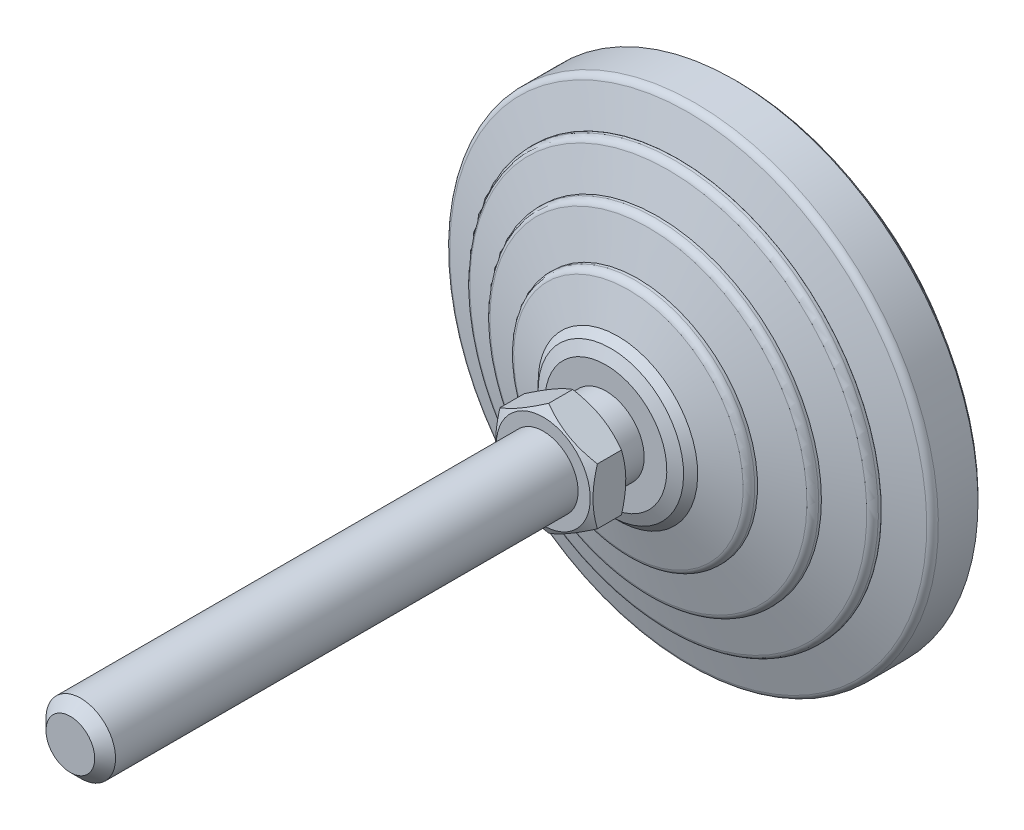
ISO-10303-21;
HEADER;
FILE_DESCRIPTION(('STEP AP214'),'2;1');
FILE_NAME('part.step','',(''),(''),'','','');
FILE_SCHEMA(('AUTOMOTIVE_DESIGN { 1 0 10303 214 1 1 1 1 }'));
ENDSEC;
DATA;
#1=APPLICATION_CONTEXT('core data for automotive mechanical design processes');
#2=APPLICATION_PROTOCOL_DEFINITION('international standard','automotive_design',2000,#1);
#3=PRODUCT_CONTEXT('',#1,'mechanical');
#4=PRODUCT('Part','Part','',(#3));
#5=PRODUCT_RELATED_PRODUCT_CATEGORY('part','',(#4));
#6=PRODUCT_DEFINITION_FORMATION('','',#4);
#7=PRODUCT_DEFINITION_CONTEXT('part definition',#1,'design');
#8=PRODUCT_DEFINITION('design','',#6,#7);
#9=PRODUCT_DEFINITION_SHAPE('','',#8);
#10=(LENGTH_UNIT() NAMED_UNIT(*) SI_UNIT(.MILLI.,.METRE.));
#11=(NAMED_UNIT(*) PLANE_ANGLE_UNIT() SI_UNIT($,.RADIAN.));
#12=(NAMED_UNIT(*) SI_UNIT($,.STERADIAN.) SOLID_ANGLE_UNIT());
#13=UNCERTAINTY_MEASURE_WITH_UNIT(LENGTH_MEASURE(1.E-05),#10,'distance_accuracy_value','');
#14=(GEOMETRIC_REPRESENTATION_CONTEXT(3) GLOBAL_UNCERTAINTY_ASSIGNED_CONTEXT((#13)) GLOBAL_UNIT_ASSIGNED_CONTEXT((#10,
#11,#12)) REPRESENTATION_CONTEXT('',''));
#15=CARTESIAN_POINT('',(0.,0.,0.));
#16=DIRECTION('',(0.,0.,1.));
#17=DIRECTION('',(1.,0.,0.));
#18=AXIS2_PLACEMENT_3D('',#15,#16,#17);
#19=CARTESIAN_POINT('',(0.,0.,22.));
#20=DIRECTION('',(0.,0.,-1.));
#21=DIRECTION('',(0.,1.,0.));
#22=AXIS2_PLACEMENT_3D('',#19,#20,#21);
#23=CONICAL_SURFACE('',#22,8.75409836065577,1.17809724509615);
#24=CARTESIAN_POINT('',(0.,0.,21.2928932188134));
#25=DIRECTION('',(0.,0.,-1.));
#26=DIRECTION('',(0.,1.,0.));
#27=AXIS2_PLACEMENT_3D('',#24,#25,#26);
#28=CIRCLE('',#27,10.4612051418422);
#29=CARTESIAN_POINT('',(0.,10.4612051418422,21.2928932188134));
#30=VERTEX_POINT('',#29);
#31=EDGE_CURVE('E27',#30,#30,#28,.T.);
#32=ORIENTED_EDGE('',*,*,#31,.F.);
#33=EDGE_LOOP('',(#32));
#34=FACE_BOUND('',#33,.T.);
#35=CARTESIAN_POINT('',(0.,0.,22.));
#36=DIRECTION('',(0.,0.,-1.));
#37=DIRECTION('',(0.,1.,0.));
#38=AXIS2_PLACEMENT_3D('',#35,#36,#37);
#39=CIRCLE('',#38,8.75409836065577);
#40=CARTESIAN_POINT('',(0.,8.75409836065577,22.));
#41=VERTEX_POINT('',#40);
#42=EDGE_CURVE('E95',#41,#41,#39,.T.);
#43=ORIENTED_EDGE('',*,*,#42,.T.);
#44=EDGE_LOOP('',(#43));
#45=FACE_BOUND('',#44,.T.);
#46=ADVANCED_FACE('F14',(#34,#45),#23,.T.);
#47=CARTESIAN_POINT('',(0.,0.,21.2928932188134));
#48=DIRECTION('',(0.,0.,-1.));
#49=DIRECTION('',(0.,1.,0.));
#50=AXIS2_PLACEMENT_3D('',#47,#48,#49);
#51=CONICAL_SURFACE('',#50,10.4612051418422,0.785398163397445);
#52=CARTESIAN_POINT('',(0.,0.,20.2786885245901));
#53=DIRECTION('',(0.,0.,-1.));
#54=DIRECTION('',(0.,1.,0.));
#55=AXIS2_PLACEMENT_3D('',#52,#53,#54);
#56=CIRCLE('',#55,11.4754098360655);
#57=CARTESIAN_POINT('',(0.,11.4754098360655,20.2786885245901));
#58=VERTEX_POINT('',#57);
#59=EDGE_CURVE('E161',#58,#58,#56,.T.);
#60=ORIENTED_EDGE('',*,*,#59,.F.);
#61=EDGE_LOOP('',(#60));
#62=FACE_BOUND('',#61,.T.);
#63=ORIENTED_EDGE('',*,*,#31,.T.);
#64=EDGE_LOOP('',(#63));
#65=FACE_BOUND('',#64,.T.);
#66=ADVANCED_FACE('F166',(#62,#65),#51,.T.);
#67=CARTESIAN_POINT('',(0.,0.,20.2786885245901));
#68=DIRECTION('',(0.,0.,-1.));
#69=DIRECTION('',(0.,1.,0.));
#70=AXIS2_PLACEMENT_3D('',#67,#68,#69);
#71=CONICAL_SURFACE('',#70,11.4754098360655,1.27933953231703);
#72=CARTESIAN_POINT('',(0.,0.,18.7711726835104));
#73=DIRECTION('',(0.,0.,-1.));
#74=DIRECTION('',(0.,1.,0.));
#75=AXIS2_PLACEMENT_3D('',#72,#73,#74);
#76=CIRCLE('',#75,16.5004626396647);
#77=CARTESIAN_POINT('',(0.,16.5004626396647,18.7711726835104));
#78=VERTEX_POINT('',#77);
#79=EDGE_CURVE('E158',#78,#78,#76,.T.);
#80=ORIENTED_EDGE('',*,*,#79,.F.);
#81=EDGE_LOOP('',(#80));
#82=FACE_BOUND('',#81,.T.);
#83=ORIENTED_EDGE('',*,*,#59,.T.);
#84=EDGE_LOOP('',(#83));
#85=FACE_BOUND('',#84,.T.);
#86=ADVANCED_FACE('F274',(#82,#85),#71,.T.);
#87=CARTESIAN_POINT('',(0.,0.,17.8133463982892));
#88=DIRECTION('',(0.,0.,-1.));
#89=DIRECTION('',(0.,1.,0.));
#90=AXIS2_PLACEMENT_3D('',#87,#88,#89);
#91=TOROIDAL_SURFACE('',#90,16.2131147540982,1.00000000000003);
#92=CARTESIAN_POINT('',(0.,0.,17.8133463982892));
#93=DIRECTION('',(0.,0.,-1.));
#94=DIRECTION('',(0.,1.,0.));
#95=AXIS2_PLACEMENT_3D('',#92,#93,#94);
#96=CIRCLE('',#95,17.2131147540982);
#97=CARTESIAN_POINT('',(0.,17.2131147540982,17.8133463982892));
#98=VERTEX_POINT('',#97);
#99=EDGE_CURVE('E155',#98,#98,#96,.T.);
#100=ORIENTED_EDGE('',*,*,#99,.F.);
#101=EDGE_LOOP('',(#100));
#102=FACE_BOUND('',#101,.T.);
#103=ORIENTED_EDGE('',*,*,#79,.T.);
#104=EDGE_LOOP('',(#103));
#105=FACE_BOUND('',#104,.T.);
#106=ADVANCED_FACE('F270',(#102,#105),#91,.T.);
#107=CARTESIAN_POINT('',(0.,0.,0.));
#108=DIRECTION('',(0.,0.,-1.));
#109=DIRECTION('',(0.,1.,0.));
#110=AXIS2_PLACEMENT_3D('',#107,#108,#109);
#111=CYLINDRICAL_SURFACE('',#110,17.2131147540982);
#112=CARTESIAN_POINT('',(0.,0.,17.4098360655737));
#113=DIRECTION('',(0.,0.,-1.));
#114=DIRECTION('',(0.,1.,0.));
#115=AXIS2_PLACEMENT_3D('',#112,#113,#114);
#116=CIRCLE('',#115,17.2131147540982);
#117=CARTESIAN_POINT('',(0.,17.2131147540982,17.4098360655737));
#118=VERTEX_POINT('',#117);
#119=EDGE_CURVE('E152',#118,#118,#116,.T.);
#120=ORIENTED_EDGE('',*,*,#119,.F.);
#121=EDGE_LOOP('',(#120));
#122=FACE_BOUND('',#121,.T.);
#123=ORIENTED_EDGE('',*,*,#99,.T.);
#124=EDGE_LOOP('',(#123));
#125=FACE_BOUND('',#124,.T.);
#126=ADVANCED_FACE('F266',(#122,#125),#111,.T.);
#127=CARTESIAN_POINT('',(0.,0.,17.4098360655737));
#128=DIRECTION('',(0.,0.,-1.));
#129=DIRECTION('',(0.,1.,0.));
#130=AXIS2_PLACEMENT_3D('',#127,#128,#129);
#131=CONICAL_SURFACE('',#130,17.2131147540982,1.30454427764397);
#132=CARTESIAN_POINT('',(0.,0.,15.8894925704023));
#133=DIRECTION('',(0.,0.,-1.));
#134=DIRECTION('',(0.,1.,0.));
#135=AXIS2_PLACEMENT_3D('',#132,#133,#134);
#136=CIRCLE('',#135,22.7877075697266);
#137=CARTESIAN_POINT('',(0.,22.7877075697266,15.8894925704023));
#138=VERTEX_POINT('',#137);
#139=EDGE_CURVE('E149',#138,#138,#136,.T.);
#140=ORIENTED_EDGE('',*,*,#139,.F.);
#141=EDGE_LOOP('',(#140));
#142=FACE_BOUND('',#141,.T.);
#143=ORIENTED_EDGE('',*,*,#119,.T.);
#144=EDGE_LOOP('',(#143));
#145=FACE_BOUND('',#144,.T.);
#146=ADVANCED_FACE('F262',(#142,#145),#131,.T.);
#147=CARTESIAN_POINT('',(0.,0.,14.9247287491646));
#148=DIRECTION('',(0.,0.,-1.));
#149=DIRECTION('',(0.,1.,0.));
#150=AXIS2_PLACEMENT_3D('',#147,#148,#149);
#151=TOROIDAL_SURFACE('',#150,22.5245901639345,1.);
#152=CARTESIAN_POINT('',(0.,0.,14.9247287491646));
#153=DIRECTION('',(0.,0.,-1.));
#154=DIRECTION('',(0.,1.,0.));
#155=AXIS2_PLACEMENT_3D('',#152,#153,#154);
#156=CIRCLE('',#155,23.5245901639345);
#157=CARTESIAN_POINT('',(0.,23.5245901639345,14.9247287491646));
#158=VERTEX_POINT('',#157);
#159=EDGE_CURVE('E146',#158,#158,#156,.T.);
#160=ORIENTED_EDGE('',*,*,#159,.F.);
#161=EDGE_LOOP('',(#160));
#162=FACE_BOUND('',#161,.T.);
#163=ORIENTED_EDGE('',*,*,#139,.T.);
#164=EDGE_LOOP('',(#163));
#165=FACE_BOUND('',#164,.T.);
#166=ADVANCED_FACE('F258',(#162,#165),#151,.T.);
#167=CARTESIAN_POINT('',(0.,0.,0.));
#168=DIRECTION('',(0.,0.,-1.));
#169=DIRECTION('',(0.,1.,0.));
#170=AXIS2_PLACEMENT_3D('',#167,#168,#169);
#171=CYLINDRICAL_SURFACE('',#170,23.5245901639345);
#172=CARTESIAN_POINT('',(0.,0.,14.5409836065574));
#173=DIRECTION('',(0.,0.,-1.));
#174=DIRECTION('',(0.,1.,0.));
#175=AXIS2_PLACEMENT_3D('',#172,#173,#174);
#176=CIRCLE('',#175,23.5245901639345);
#177=CARTESIAN_POINT('',(0.,23.5245901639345,14.5409836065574));
#178=VERTEX_POINT('',#177);
#179=EDGE_CURVE('E143',#178,#178,#176,.T.);
#180=ORIENTED_EDGE('',*,*,#179,.F.);
#181=EDGE_LOOP('',(#180));
#182=FACE_BOUND('',#181,.T.);
#183=ORIENTED_EDGE('',*,*,#159,.T.);
#184=EDGE_LOOP('',(#183));
#185=FACE_BOUND('',#184,.T.);
#186=ADVANCED_FACE('F254',(#182,#185),#171,.T.);
#187=CARTESIAN_POINT('',(0.,0.,14.5409836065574));
#188=DIRECTION('',(0.,0.,-1.));
#189=DIRECTION('',(0.,1.,0.));
#190=AXIS2_PLACEMENT_3D('',#187,#188,#189);
#191=CONICAL_SURFACE('',#190,23.5245901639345,1.27871257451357);
#192=CARTESIAN_POINT('',(0.,0.,13.0337743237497));
#193=DIRECTION('',(0.,0.,-1.));
#194=DIRECTION('',(0.,1.,0.));
#195=AXIS2_PLACEMENT_3D('',#192,#193,#194);
#196=CIRCLE('',#195,28.5372004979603);
#197=CARTESIAN_POINT('',(0.,28.5372004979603,13.0337743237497));
#198=VERTEX_POINT('',#197);
#199=EDGE_CURVE('E140',#198,#198,#196,.T.);
#200=ORIENTED_EDGE('',*,*,#199,.F.);
#201=EDGE_LOOP('',(#200));
#202=FACE_BOUND('',#201,.T.);
#203=ORIENTED_EDGE('',*,*,#179,.T.);
#204=EDGE_LOOP('',(#203));
#205=FACE_BOUND('',#204,.T.);
#206=ADVANCED_FACE('F250',(#202,#205),#191,.T.);
#207=CARTESIAN_POINT('',(0.,0.,12.0761283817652));
#208=DIRECTION('',(0.,0.,-1.));
#209=DIRECTION('',(0.,1.,0.));
#210=AXIS2_PLACEMENT_3D('',#207,#208,#209);
#211=TOROIDAL_SURFACE('',#210,28.2492521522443,0.999999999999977);
#212=CARTESIAN_POINT('',(0.,0.,12.0761283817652));
#213=DIRECTION('',(0.,0.,-1.));
#214=DIRECTION('',(0.,1.,0.));
#215=AXIS2_PLACEMENT_3D('',#212,#213,#214);
#216=CIRCLE('',#215,29.2492521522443);
#217=CARTESIAN_POINT('',(0.,29.2492521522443,12.0761283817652));
#218=VERTEX_POINT('',#217);
#219=EDGE_CURVE('E137',#218,#218,#216,.T.);
#220=ORIENTED_EDGE('',*,*,#219,.F.);
#221=EDGE_LOOP('',(#220));
#222=FACE_BOUND('',#221,.T.);
#223=ORIENTED_EDGE('',*,*,#199,.T.);
#224=EDGE_LOOP('',(#223));
#225=FACE_BOUND('',#224,.T.);
#226=ADVANCED_FACE('F246',(#222,#225),#211,.T.);
#227=CARTESIAN_POINT('',(0.,0.,0.));
#228=DIRECTION('',(0.,0.,-1.));
#229=DIRECTION('',(0.,1.,0.));
#230=AXIS2_PLACEMENT_3D('',#227,#228,#229);
#231=CYLINDRICAL_SURFACE('',#230,29.2492521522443);
#232=CARTESIAN_POINT('',(0.,0.,11.6721311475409));
#233=DIRECTION('',(0.,0.,-1.));
#234=DIRECTION('',(0.,1.,0.));
#235=AXIS2_PLACEMENT_3D('',#232,#233,#234);
#236=CIRCLE('',#235,29.2492521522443);
#237=CARTESIAN_POINT('',(0.,29.2492521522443,11.6721311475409));
#238=VERTEX_POINT('',#237);
#239=EDGE_CURVE('E134',#238,#238,#236,.T.);
#240=ORIENTED_EDGE('',*,*,#239,.F.);
#241=EDGE_LOOP('',(#240));
#242=FACE_BOUND('',#241,.T.);
#243=ORIENTED_EDGE('',*,*,#219,.T.);
#244=EDGE_LOOP('',(#243));
#245=FACE_BOUND('',#244,.T.);
#246=ADVANCED_FACE('F242',(#242,#245),#231,.T.);
#247=CARTESIAN_POINT('',(-29.2622950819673,0.,11.6721311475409));
#248=DIRECTION('',(0.,0.,-1.));
#249=DIRECTION('',(0.,1.,0.));
#250=AXIS2_PLACEMENT_3D('',#247,#248,#249);
#251=PLANE('',#250);
#252=CARTESIAN_POINT('',(0.,0.,11.6721311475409));
#253=DIRECTION('',(0.,0.,-1.));
#254=DIRECTION('',(0.,1.,0.));
#255=AXIS2_PLACEMENT_3D('',#252,#253,#254);
#256=CIRCLE('',#255,29.2622950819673);
#257=CARTESIAN_POINT('',(0.,29.2622950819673,11.6721311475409));
#258=VERTEX_POINT('',#257);
#259=EDGE_CURVE('E131',#258,#258,#256,.T.);
#260=ORIENTED_EDGE('',*,*,#259,.F.);
#261=EDGE_LOOP('',(#260));
#262=FACE_BOUND('',#261,.T.);
#263=ORIENTED_EDGE('',*,*,#239,.T.);
#264=EDGE_LOOP('',(#263));
#265=FACE_BOUND('',#264,.T.);
#266=ADVANCED_FACE('F238',(#262,#265),#251,.F.);
#267=CARTESIAN_POINT('',(0.,0.,11.6721311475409));
#268=DIRECTION('',(0.,0.,-1.));
#269=DIRECTION('',(0.,1.,0.));
#270=AXIS2_PLACEMENT_3D('',#267,#268,#269);
#271=CONICAL_SURFACE('',#270,29.2622950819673,1.27933953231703);
#272=CARTESIAN_POINT('',(0.,0.,10.1646153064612));
#273=DIRECTION('',(0.,0.,-1.));
#274=DIRECTION('',(0.,1.,0.));
#275=AXIS2_PLACEMENT_3D('',#272,#273,#274);
#276=CIRCLE('',#275,34.2873478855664);
#277=CARTESIAN_POINT('',(0.,34.2873478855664,10.1646153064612));
#278=VERTEX_POINT('',#277);
#279=EDGE_CURVE('E128',#278,#278,#276,.T.);
#280=ORIENTED_EDGE('',*,*,#279,.F.);
#281=EDGE_LOOP('',(#280));
#282=FACE_BOUND('',#281,.T.);
#283=ORIENTED_EDGE('',*,*,#259,.T.);
#284=EDGE_LOOP('',(#283));
#285=FACE_BOUND('',#284,.T.);
#286=ADVANCED_FACE('F234',(#282,#285),#271,.T.);
#287=CARTESIAN_POINT('',(0.,0.,9.20678902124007));
#288=DIRECTION('',(0.,0.,-1.));
#289=DIRECTION('',(0.,1.,0.));
#290=AXIS2_PLACEMENT_3D('',#287,#288,#289);
#291=TOROIDAL_SURFACE('',#290,34.,1.);
#292=CARTESIAN_POINT('',(0.,0.,9.20678902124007));
#293=DIRECTION('',(0.,0.,-1.));
#294=DIRECTION('',(0.,1.,0.));
#295=AXIS2_PLACEMENT_3D('',#292,#293,#294);
#296=CIRCLE('',#295,35.);
#297=CARTESIAN_POINT('',(0.,35.,9.20678902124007));
#298=VERTEX_POINT('',#297);
#299=EDGE_CURVE('E125',#298,#298,#296,.T.);
#300=ORIENTED_EDGE('',*,*,#299,.F.);
#301=EDGE_LOOP('',(#300));
#302=FACE_BOUND('',#301,.T.);
#303=ORIENTED_EDGE('',*,*,#279,.T.);
#304=EDGE_LOOP('',(#303));
#305=FACE_BOUND('',#304,.T.);
#306=ADVANCED_FACE('F230',(#302,#305),#291,.T.);
#307=CARTESIAN_POINT('',(0.,0.,0.));
#308=DIRECTION('',(0.,0.,-1.));
#309=DIRECTION('',(0.,1.,0.));
#310=AXIS2_PLACEMENT_3D('',#307,#308,#309);
#311=CYLINDRICAL_SURFACE('',#310,35.);
#312=CARTESIAN_POINT('',(0.,0.,3.5));
#313=DIRECTION('',(0.,0.,-1.));
#314=DIRECTION('',(0.,1.,0.));
#315=AXIS2_PLACEMENT_3D('',#312,#313,#314);
#316=CIRCLE('',#315,35.);
#317=CARTESIAN_POINT('',(0.,35.,3.5));
#318=VERTEX_POINT('',#317);
#319=EDGE_CURVE('E122',#318,#318,#316,.T.);
#320=ORIENTED_EDGE('',*,*,#319,.F.);
#321=EDGE_LOOP('',(#320));
#322=FACE_BOUND('',#321,.T.);
#323=ORIENTED_EDGE('',*,*,#299,.T.);
#324=EDGE_LOOP('',(#323));
#325=FACE_BOUND('',#324,.T.);
#326=ADVANCED_FACE('F226',(#322,#325),#311,.T.);
#327=CARTESIAN_POINT('',(0.,0.,3.5));
#328=DIRECTION('',(0.,0.,1.));
#329=DIRECTION('',(0.,-1.,0.));
#330=AXIS2_PLACEMENT_3D('',#327,#328,#329);
#331=CONICAL_SURFACE('',#330,35.,0.785398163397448);
#332=CARTESIAN_POINT('',(0.,0.,3.));
#333=DIRECTION('',(0.,0.,-1.));
#334=DIRECTION('',(0.,1.,0.));
#335=AXIS2_PLACEMENT_3D('',#332,#333,#334);
#336=CIRCLE('',#335,34.5);
#337=CARTESIAN_POINT('',(0.,34.5,3.));
#338=VERTEX_POINT('',#337);
#339=EDGE_CURVE('E119',#338,#338,#336,.T.);
#340=ORIENTED_EDGE('',*,*,#339,.F.);
#341=EDGE_LOOP('',(#340));
#342=FACE_BOUND('',#341,.T.);
#343=ORIENTED_EDGE('',*,*,#319,.T.);
#344=EDGE_LOOP('',(#343));
#345=FACE_BOUND('',#344,.T.);
#346=ADVANCED_FACE('F222',(#342,#345),#331,.T.);
#347=CARTESIAN_POINT('',(-34.5,0.,3.));
#348=DIRECTION('',(0.,0.,1.));
#349=DIRECTION('',(0.,-1.,0.));
#350=AXIS2_PLACEMENT_3D('',#347,#348,#349);
#351=PLANE('',#350);
#352=CARTESIAN_POINT('',(0.,0.,3.));
#353=DIRECTION('',(0.,0.,-1.));
#354=DIRECTION('',(0.,1.,0.));
#355=AXIS2_PLACEMENT_3D('',#352,#353,#354);
#356=CIRCLE('',#355,30.4098360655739);
#357=CARTESIAN_POINT('',(0.,30.4098360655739,3.));
#358=VERTEX_POINT('',#357);
#359=EDGE_CURVE('E116',#358,#358,#356,.T.);
#360=ORIENTED_EDGE('',*,*,#359,.F.);
#361=EDGE_LOOP('',(#360));
#362=FACE_BOUND('',#361,.T.);
#363=ORIENTED_EDGE('',*,*,#339,.T.);
#364=EDGE_LOOP('',(#363));
#365=FACE_BOUND('',#364,.T.);
#366=ADVANCED_FACE('F218',(#362,#365),#351,.F.);
#367=CARTESIAN_POINT('',(0.,0.,0.));
#368=DIRECTION('',(0.,0.,-1.));
#369=DIRECTION('',(0.,1.,0.));
#370=AXIS2_PLACEMENT_3D('',#367,#368,#369);
#371=CYLINDRICAL_SURFACE('',#370,30.4098360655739);
#372=CARTESIAN_POINT('',(0.,0.,0.));
#373=DIRECTION('',(0.,0.,-1.));
#374=DIRECTION('',(0.,1.,0.));
#375=AXIS2_PLACEMENT_3D('',#372,#373,#374);
#376=CIRCLE('',#375,30.4098360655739);
#377=CARTESIAN_POINT('',(0.,30.4098360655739,0.));
#378=VERTEX_POINT('',#377);
#379=EDGE_CURVE('E113',#378,#378,#376,.T.);
#380=ORIENTED_EDGE('',*,*,#379,.F.);
#381=EDGE_LOOP('',(#380));
#382=FACE_BOUND('',#381,.T.);
#383=ORIENTED_EDGE('',*,*,#359,.T.);
#384=EDGE_LOOP('',(#383));
#385=FACE_BOUND('',#384,.T.);
#386=ADVANCED_FACE('F194',(#382,#385),#371,.T.);
#387=CARTESIAN_POINT('',(-30.4098360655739,0.,0.));
#388=DIRECTION('',(0.,0.,1.));
#389=DIRECTION('',(0.,-1.,0.));
#390=AXIS2_PLACEMENT_3D('',#387,#388,#389);
#391=PLANE('',#390);
#392=ORIENTED_EDGE('',*,*,#379,.T.);
#393=EDGE_LOOP('',(#392));
#394=FACE_BOUND('',#393,.T.);
#395=ADVANCED_FACE('F186',(#394),#391,.F.);
#396=CARTESIAN_POINT('',(-5.50000000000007,0.,26.));
#397=DIRECTION('',(0.,0.,1.));
#398=DIRECTION('',(0.,-1.,0.));
#399=AXIS2_PLACEMENT_3D('',#396,#397,#398);
#400=PLANE('',#399);
#401=CARTESIAN_POINT('',(0.,0.,25.9999999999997));
#402=DIRECTION('',(0.,0.,-1.));
#403=DIRECTION('',(-1.,0.,0.));
#404=AXIS2_PLACEMENT_3D('',#401,#402,#403);
#405=CIRCLE('',#404,6.75);
#406=CARTESIAN_POINT('',(-6.75,0.,25.9999999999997));
#407=VERTEX_POINT('',#406);
#408=EDGE_CURVE('E598',#407,#407,#405,.T.);
#409=ORIENTED_EDGE('',*,*,#408,.T.);
#410=EDGE_LOOP('',(#409));
#411=FACE_BOUND('',#410,.T.);
#412=CARTESIAN_POINT('',(0.,0.,26.));
#413=DIRECTION('',(0.,0.,-1.));
#414=DIRECTION('',(0.,1.,0.));
#415=AXIS2_PLACEMENT_3D('',#412,#413,#414);
#416=CIRCLE('',#415,5.50000000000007);
#417=CARTESIAN_POINT('',(0.,5.50000000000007,26.));
#418=VERTEX_POINT('',#417);
#419=EDGE_CURVE('E101',#418,#418,#416,.T.);
#420=ORIENTED_EDGE('',*,*,#419,.F.);
#421=EDGE_LOOP('',(#420));
#422=FACE_BOUND('',#421,.T.);
#423=ADVANCED_FACE('F181',(#411,#422),#400,.F.);
#424=CARTESIAN_POINT('',(0.,0.,0.));
#425=DIRECTION('',(0.,0.,-1.));
#426=DIRECTION('',(0.,1.,0.));
#427=AXIS2_PLACEMENT_3D('',#424,#425,#426);
#428=CYLINDRICAL_SURFACE('',#427,5.50000000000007);
#429=CARTESIAN_POINT('',(0.,0.,22.));
#430=DIRECTION('',(0.,0.,-1.));
#431=DIRECTION('',(0.,1.,0.));
#432=AXIS2_PLACEMENT_3D('',#429,#430,#431);
#433=CIRCLE('',#432,5.50000000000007);
#434=CARTESIAN_POINT('',(0.,5.50000000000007,22.));
#435=VERTEX_POINT('',#434);
#436=EDGE_CURVE('E98',#435,#435,#433,.T.);
#437=ORIENTED_EDGE('',*,*,#436,.F.);
#438=EDGE_LOOP('',(#437));
#439=FACE_BOUND('',#438,.T.);
#440=ORIENTED_EDGE('',*,*,#419,.T.);
#441=EDGE_LOOP('',(#440));
#442=FACE_BOUND('',#441,.T.);
#443=ADVANCED_FACE('F175',(#439,#442),#428,.T.);
#444=CARTESIAN_POINT('',(-8.75409836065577,0.,22.));
#445=DIRECTION('',(0.,0.,-1.));
#446=DIRECTION('',(0.,1.,0.));
#447=AXIS2_PLACEMENT_3D('',#444,#445,#446);
#448=PLANE('',#447);
#449=ORIENTED_EDGE('',*,*,#42,.F.);
#450=EDGE_LOOP('',(#449));
#451=FACE_BOUND('',#450,.T.);
#452=ORIENTED_EDGE('',*,*,#436,.T.);
#453=EDGE_LOOP('',(#452));
#454=FACE_BOUND('',#453,.T.);
#455=ADVANCED_FACE('F172',(#451,#454),#448,.F.);
#456=CARTESIAN_POINT('',(0.,0.,27.3191599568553));
#457=DIRECTION('',(0.,0.,1.));
#458=DIRECTION('',(1.,0.,0.));
#459=AXIS2_PLACEMENT_3D('',#456,#457,#458);
#460=CONICAL_SURFACE('',#459,9.03485206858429,1.0471975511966);
#461=CARTESIAN_POINT('',(0.258552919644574,-8.23217936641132,26.8580802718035));
#462=CARTESIAN_POINT('',(-0.0681215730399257,-8.04357376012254,26.7433090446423));
#463=CARTESIAN_POINT('',(-0.39785101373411,-7.85320437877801,26.638259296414));
#464=CARTESIAN_POINT('',(-1.06369175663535,-7.46878104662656,26.4538188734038));
#465=CARTESIAN_POINT('',(-1.39981994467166,-7.27471734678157,26.3745104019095));
#466=CARTESIAN_POINT('',(-1.9025944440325,-6.98444035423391,26.2809632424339));
#467=CARTESIAN_POINT('',(-2.06749180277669,-6.8892368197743,26.2542371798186));
#468=CARTESIAN_POINT('',(-2.39815048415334,-6.6983309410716,26.2091359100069));
#469=CARTESIAN_POINT('',(-2.56391181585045,-6.60262859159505,26.1907607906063));
#470=CARTESIAN_POINT('',(-2.89572853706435,-6.41105411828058,26.1628857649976));
#471=CARTESIAN_POINT('',(-3.06178301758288,-6.31518251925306,26.1533715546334));
#472=CARTESIAN_POINT('',(-3.3940969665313,-6.12332097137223,26.1434392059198));
#473=CARTESIAN_POINT('',(-3.56035643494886,-6.02733102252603,26.1430210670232));
#474=CARTESIAN_POINT('',(-3.90303457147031,-5.82948570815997,26.1515525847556));
#475=CARTESIAN_POINT('',(-4.07944244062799,-5.72763657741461,26.1610860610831));
#476=CARTESIAN_POINT('',(-4.43164016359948,-5.52429512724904,26.190123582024));
#477=CARTESIAN_POINT('',(-4.60742999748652,-5.42280281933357,26.209627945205));
#478=CARTESIAN_POINT('',(-4.95836017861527,-5.22019318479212,26.2580581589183));
#479=CARTESIAN_POINT('',(-5.1334986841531,-5.11907692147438,26.2870016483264));
#480=CARTESIAN_POINT('',(-5.48254687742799,-4.91755385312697,26.3535070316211));
#481=CARTESIAN_POINT('',(-5.65645647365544,-4.81714710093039,26.3910695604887));
#482=CARTESIAN_POINT('',(-6.00841188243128,-4.61394555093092,26.4752373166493));
#483=CARTESIAN_POINT('',(-6.18641248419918,-4.51117685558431,26.5220929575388));
#484=CARTESIAN_POINT('',(-6.54088137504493,-4.30652414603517,26.6230270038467));
#485=CARTESIAN_POINT('',(-6.71734949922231,-4.20464022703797,26.6771061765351));
#486=CARTESIAN_POINT('',(-7.06802035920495,-4.00218031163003,26.7912840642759));
#487=CARTESIAN_POINT('',(-7.24222944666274,-3.901600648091,26.8513569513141));
#488=CARTESIAN_POINT('',(-7.58912943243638,-3.70131784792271,26.9768461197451));
#489=CARTESIAN_POINT('',(-7.76182087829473,-3.60161439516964,27.0422603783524));
#490=CARTESIAN_POINT('',(-7.93382295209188,-3.50230895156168,27.1099378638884));
#491=B_SPLINE_CURVE_WITH_KNOTS('',3,(#461,#462,#463,#464,#465,#466,#467,#468,#469,#470,#471,
#472,#473,#474,#475,#476,#477,#478,#479,#480,#481,#482,#483,#484,#485,#486,#487,#488,#489,#490),
.UNSPECIFIED.,.F.,.F.,(4,2,2,2,2,2,2,2,2,2,2,2,2,2,4),(0.,1.18360012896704,2.3709436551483,
2.94759554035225,3.52425348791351,4.099978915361,4.67570430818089,5.28721079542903,
5.89873682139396,6.51141221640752,7.12413276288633,7.75641527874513,8.38876500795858,
9.01849874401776,9.64799509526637),.UNSPECIFIED.);
#492=CARTESIAN_POINT('',(0.,-8.08290376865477,26.7695523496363));
#493=VERTEX_POINT('',#492);
#494=CARTESIAN_POINT('',(-7.,-4.04145188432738,26.7695523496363));
#495=VERTEX_POINT('',#494);
#496=EDGE_CURVE('E72',#493,#495,#491,.T.);
#497=ORIENTED_EDGE('',*,*,#496,.T.);
#498=CARTESIAN_POINT('',(-7.,-10.7748398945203,29.5212676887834));
#499=CARTESIAN_POINT('',(-7.,-10.4697714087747,29.3736096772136));
#500=CARTESIAN_POINT('',(-7.,-10.1639938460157,29.2273911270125));
#501=CARTESIAN_POINT('',(-7.,-9.55064314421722,28.9386442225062));
#502=CARTESIAN_POINT('',(-7.,-9.24306972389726,28.7961164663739));
#503=CARTESIAN_POINT('',(-7.,-8.62412595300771,28.5148279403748));
#504=CARTESIAN_POINT('',(-7.,-8.31274399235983,28.3760926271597));
#505=CARTESIAN_POINT('',(-7.,-7.68747492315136,28.1044089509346));
#506=CARTESIAN_POINT('',(-7.,-7.37358793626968,27.9714603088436));
#507=CARTESIAN_POINT('',(-7.,-6.73300010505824,27.7088593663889));
#508=CARTESIAN_POINT('',(-7.,-6.40620413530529,27.5794378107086));
#509=CARTESIAN_POINT('',(-7.,-5.74875990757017,27.3305873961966));
#510=CARTESIAN_POINT('',(-7.,-5.41811121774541,27.2111596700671));
#511=CARTESIAN_POINT('',(-7.,-4.75307702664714,26.9854920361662));
#512=CARTESIAN_POINT('',(-7.,-4.41870092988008,26.8792247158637));
#513=CARTESIAN_POINT('',(-7.,-3.74516568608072,26.683339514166));
#514=CARTESIAN_POINT('',(-7.,-3.40600810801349,26.5937163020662));
#515=CARTESIAN_POINT('',(-7.,-2.72452443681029,26.4359511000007));
#516=CARTESIAN_POINT('',(-7.,-2.38222529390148,26.3676958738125));
#517=CARTESIAN_POINT('',(-7.,-1.86572537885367,26.284334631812));
#518=CARTESIAN_POINT('',(-7.,-1.69303689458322,26.259716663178));
#519=CARTESIAN_POINT('',(-7.,-1.34682941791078,26.2173058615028));
#520=CARTESIAN_POINT('',(-7.,-1.17331050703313,26.1995123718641));
#521=CARTESIAN_POINT('',(-7.,-0.827905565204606,26.1713240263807));
#522=CARTESIAN_POINT('',(-7.,-0.656027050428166,26.1608374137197));
#523=CARTESIAN_POINT('',(-7.,-0.311980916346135,26.147136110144));
#524=CARTESIAN_POINT('',(-7.,-0.139813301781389,26.1439213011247));
#525=CARTESIAN_POINT('',(-7.,0.204504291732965,26.1448401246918));
#526=CARTESIAN_POINT('',(-7.,0.376654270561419,26.1489738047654));
#527=CARTESIAN_POINT('',(-7.,0.720629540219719,26.164490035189));
#528=CARTESIAN_POINT('',(-7.,0.892454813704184,26.1758729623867));
#529=CARTESIAN_POINT('',(-7.,1.3078906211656,26.2119200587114));
#530=CARTESIAN_POINT('',(-7.,1.55119702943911,26.2401617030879));
#531=CARTESIAN_POINT('',(-7.,2.03593889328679,26.3096203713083));
#532=CARTESIAN_POINT('',(-7.,2.27737407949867,26.3508392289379));
#533=CARTESIAN_POINT('',(-7.,2.99863340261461,26.4917703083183));
#534=CARTESIAN_POINT('',(-7.,3.47512853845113,26.6087293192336));
#535=CARTESIAN_POINT('',(-7.,4.18751230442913,26.8107231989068));
#536=CARTESIAN_POINT('',(-7.,4.4271163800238,26.8834011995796));
#537=CARTESIAN_POINT('',(-7.,4.90399604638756,27.0361002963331));
#538=CARTESIAN_POINT('',(-7.,5.14127162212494,27.1161214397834));
#539=CARTESIAN_POINT('',(-7.,5.61357295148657,27.2822400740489));
#540=CARTESIAN_POINT('',(-7.,5.84859946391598,27.3683354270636));
#541=CARTESIAN_POINT('',(-7.,6.31671915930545,27.5456100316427));
#542=CARTESIAN_POINT('',(-7.,6.54981236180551,27.6367892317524));
#543=CARTESIAN_POINT('',(-7.,7.08677854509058,27.8525080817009));
#544=CARTESIAN_POINT('',(-7.,7.39003565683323,27.9785776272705));
#545=CARTESIAN_POINT('',(-7.,7.99408243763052,28.2365108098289));
#546=CARTESIAN_POINT('',(-7.,8.29487197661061,28.3683747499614));
#547=CARTESIAN_POINT('',(-7.,8.89442669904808,28.6367714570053));
#548=CARTESIAN_POINT('',(-7.,9.19319147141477,28.7733051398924));
#549=CARTESIAN_POINT('',(-7.,9.78896508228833,29.0501296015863));
#550=CARTESIAN_POINT('',(-7.,10.0859739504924,29.190420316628));
#551=CARTESIAN_POINT('',(-7.,10.6787924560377,29.4742067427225));
#552=CARTESIAN_POINT('',(-7.,10.974600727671,29.6177053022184));
#553=CARTESIAN_POINT('',(-7.,11.5649688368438,29.9072500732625));
#554=CARTESIAN_POINT('',(-7.,11.8595286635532,30.0532963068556));
#555=CARTESIAN_POINT('',(-7.,12.7416388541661,30.4946035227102));
#556=CARTESIAN_POINT('',(-7.,13.3276077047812,30.7930271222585));
#557=CARTESIAN_POINT('',(-7.,14.1808083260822,31.2330727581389));
#558=CARTESIAN_POINT('',(-7.,14.4492651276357,31.3723344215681));
#559=CARTESIAN_POINT('',(-7.,14.9855959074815,31.6519654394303));
#560=CARTESIAN_POINT('',(-7.,15.2534698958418,31.7923347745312));
#561=CARTESIAN_POINT('',(-7.,16.0563547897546,32.2148923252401));
#562=CARTESIAN_POINT('',(-7.,16.5906082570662,32.4985195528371));
#563=CARTESIAN_POINT('',(-7.,17.6563164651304,33.0680558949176));
#564=CARTESIAN_POINT('',(-7.,18.1877748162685,33.3539582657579));
#565=CARTESIAN_POINT('',(-7.,19.2494038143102,33.928080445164));
#566=CARTESIAN_POINT('',(-7.,19.7795745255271,34.2163001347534));
#567=CARTESIAN_POINT('',(-7.,20.3092672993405,34.5053899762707));
#568=B_SPLINE_CURVE_WITH_KNOTS('',3,(#498,#499,#500,#501,#502,#503,#504,#505,#506,#507,#508,
#509,#510,#511,#512,#513,#514,#515,#516,#517,#518,#519,#520,#521,#522,#523,#524,#525,#526,#527,
#528,#529,#530,#531,#532,#533,#534,#535,#536,#537,#538,#539,#540,#541,#542,#543,#544,#545,#546,
#547,#548,#549,#550,#551,#552,#553,#554,#555,#556,#557,#558,#559,#560,#561,#562,#563,#564,#565,
#566,#567),.UNSPECIFIED.,.F.,.F.,(4,2,2,2,2,2,2,2,2,2,2,2,2,2,2,2,2,2,2,2,2,2,2,2,2,2,2,2,2,2,2,
2,2,2,4),(0.,1.01678566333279,2.03373510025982,3.05635893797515,4.07893340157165,
5.13327801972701,6.18774197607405,7.23997120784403,8.2918628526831,9.33808192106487,
9.86127141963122,10.3844105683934,10.9008558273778,11.4172926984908,11.9337329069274,
12.4501999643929,13.1846032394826,13.9191103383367,15.3889730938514,16.140065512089,
16.8911627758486,17.6419969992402,18.392823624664,19.3779979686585,20.3632239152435,
21.3486442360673,22.3340478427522,23.3203642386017,24.3066891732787,26.2793797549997,
27.1866637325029,28.0939319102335,29.9085370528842,31.7189711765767,33.5293129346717),.UNSPECIFIED.);
#569=CARTESIAN_POINT('',(-7.,4.04145188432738,26.7695523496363));
#570=VERTEX_POINT('',#569);
#571=EDGE_CURVE('E80',#495,#570,#568,.T.);
#572=ORIENTED_EDGE('',*,*,#571,.T.);
#573=CARTESIAN_POINT('',(-12.6450087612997,0.782304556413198,29.4174430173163));
#574=CARTESIAN_POINT('',(-12.3772861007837,0.93687430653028,29.2687248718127));
#575=CARTESIAN_POINT('',(-12.1089085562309,1.09182215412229,29.1215484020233));
#576=CARTESIAN_POINT('',(-11.5704832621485,1.40268214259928,28.8311759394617));
#577=CARTESIAN_POINT('',(-11.3004352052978,1.55859446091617,28.6879807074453));
#578=CARTESIAN_POINT('',(-10.7566962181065,1.87252231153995,28.4056351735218));
#579=CARTESIAN_POINT('',(-10.4829930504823,2.03054490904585,28.2665161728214));
#580=CARTESIAN_POINT('',(-9.93325025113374,2.34793906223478,27.9946013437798));
#581=CARTESIAN_POINT('',(-9.65721075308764,2.50731054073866,27.8618051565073));
#582=CARTESIAN_POINT('',(-9.09990112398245,2.82907340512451,27.6031289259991));
#583=CARTESIAN_POINT('',(-8.81860637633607,2.99147900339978,27.4773191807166));
#584=CARTESIAN_POINT('',(-8.25259517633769,3.31826572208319,27.2362080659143));
#585=CARTESIAN_POINT('',(-7.96787832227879,3.48264707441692,27.1209079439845));
#586=CARTESIAN_POINT('',(-7.39523473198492,3.8132630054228,26.9041564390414));
#587=CARTESIAN_POINT('',(-7.10731740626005,3.97949215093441,26.8026722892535));
#588=CARTESIAN_POINT('',(-6.52736713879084,4.31432659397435,26.6170749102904));
#589=CARTESIAN_POINT('',(-6.2353356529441,4.48293105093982,26.5329556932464));
#590=CARTESIAN_POINT('',(-5.65058110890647,4.8205392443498,26.3873544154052));
#591=CARTESIAN_POINT('',(-5.35790739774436,4.98951449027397,26.3256155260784));
#592=CARTESIAN_POINT('',(-4.91651579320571,5.2443520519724,26.2521109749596));
#593=CARTESIAN_POINT('',(-4.76896882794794,5.32953833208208,26.2307918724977));
#594=CARTESIAN_POINT('',(-4.4732620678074,5.50026470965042,26.1949443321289));
#595=CARTESIAN_POINT('',(-4.32510233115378,5.58580477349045,26.1804152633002));
#596=CARTESIAN_POINT('',(-4.02919588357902,5.75664644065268,26.1585288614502));
#597=CARTESIAN_POINT('',(-3.88145132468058,5.841946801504,26.1511328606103));
#598=CARTESIAN_POINT('',(-3.58582445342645,6.01262705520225,26.1435430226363));
#599=CARTESIAN_POINT('',(-3.4379421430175,6.09800694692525,26.14334908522));
#600=CARTESIAN_POINT('',(-3.14233896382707,6.26867352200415,26.1501678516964));
#601=CARTESIAN_POINT('',(-2.99461806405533,6.3539602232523,26.1571787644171));
#602=CARTESIAN_POINT('',(-2.69955091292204,6.52431732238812,26.1782418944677));
#603=CARTESIAN_POINT('',(-2.55220468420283,6.60938770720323,26.1922945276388));
#604=CARTESIAN_POINT('',(-2.18785005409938,6.81974795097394,26.2354690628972));
#605=CARTESIAN_POINT('',(-1.97119019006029,6.9448365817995,26.2685828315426));
#606=CARTESIAN_POINT('',(-1.53971970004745,7.19394618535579,26.3481271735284));
#607=CARTESIAN_POINT('',(-1.32490938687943,7.31796697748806,26.3945599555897));
#608=CARTESIAN_POINT('',(-0.682801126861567,7.68868835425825,26.551486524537));
#609=CARTESIAN_POINT('',(-0.258684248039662,7.93355234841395,26.6794943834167));
#610=CARTESIAN_POINT('',(0.375311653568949,8.2995900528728,26.897994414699));
#611=CARTESIAN_POINT('',(0.588545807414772,8.4227008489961,26.9762259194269));
#612=CARTESIAN_POINT('',(1.01295573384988,8.66773403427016,27.1399401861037));
#613=CARTESIAN_POINT('',(1.22413132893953,8.78965632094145,27.2254235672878));
#614=CARTESIAN_POINT('',(1.64336407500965,9.03170045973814,27.4018526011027));
#615=CARTESIAN_POINT('',(1.85143219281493,9.1518286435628,27.4927638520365));
#616=CARTESIAN_POINT('',(2.2658341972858,9.39108375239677,27.6794940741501));
#617=CARTESIAN_POINT('',(2.47216863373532,9.51021099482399,27.7753114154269));
#618=CARTESIAN_POINT('',(2.67777882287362,9.62892009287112,27.8731139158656));
#619=B_SPLINE_CURVE_WITH_KNOTS('',3,(#573,#574,#575,#576,#577,#578,#579,#580,#581,#582,#583,
#584,#585,#586,#587,#588,#589,#590,#591,#592,#593,#594,#595,#596,#597,#598,#599,#600,#601,#602,
#603,#604,#605,#606,#607,#608,#609,#610,#611,#612,#613,#614,#615,#616,#617,#618),.UNSPECIFIED.,
.F.,.F.,(4,2,2,2,2,2,2,2,2,2,2,2,2,2,2,2,2,2,2,2,2,2,4),(0.,1.02916974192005,2.05853480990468,
3.09440857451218,4.13022346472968,5.17505849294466,6.22001739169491,7.26245314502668,
8.30452883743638,9.33423622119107,9.84922559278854,10.3641671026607,10.876301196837,
11.3884281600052,11.9004278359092,12.4124577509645,13.1690998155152,13.925867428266,
15.4423827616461,16.2173831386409,16.9924497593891,17.7630396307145,18.5333751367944),.UNSPECIFIED.);
#620=CARTESIAN_POINT('',(0.,8.08290376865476,26.7695523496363));
#621=VERTEX_POINT('',#620);
#622=EDGE_CURVE('E553',#570,#621,#619,.T.);
#623=ORIENTED_EDGE('',*,*,#622,.T.);
#624=CARTESIAN_POINT('',(-0.939458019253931,8.62530010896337,27.1121565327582));
#625=CARTESIAN_POINT('',(-0.767375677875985,8.52594832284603,27.0443914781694));
#626=CARTESIAN_POINT('',(-0.594603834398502,8.42619845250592,26.9788882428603));
#627=CARTESIAN_POINT('',(-0.247542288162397,8.22582237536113,26.8532186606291));
#628=CARTESIAN_POINT('',(-0.0732520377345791,8.12519585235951,26.7930543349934));
#629=CARTESIAN_POINT('',(0.277584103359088,7.92264051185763,26.6786906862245));
#630=CARTESIAN_POINT('',(0.454136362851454,7.82070801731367,26.6245172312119));
#631=CARTESIAN_POINT('',(0.808775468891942,7.61595703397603,26.5233935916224));
#632=CARTESIAN_POINT('',(0.986862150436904,7.51313864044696,26.4764426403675));
#633=CARTESIAN_POINT('',(1.33898690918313,7.30983931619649,26.3920883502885));
#634=CARTESIAN_POINT('',(1.51297967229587,7.20938454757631,26.354434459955));
#635=CARTESIAN_POINT('',(1.86219724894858,7.00776368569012,26.2877485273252));
#636=CARTESIAN_POINT('',(2.03742197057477,6.90659764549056,26.258715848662));
#637=CARTESIAN_POINT('',(2.38852757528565,6.70388673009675,26.2101121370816));
#638=CARTESIAN_POINT('',(2.56440660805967,6.60234292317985,26.1905234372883));
#639=CARTESIAN_POINT('',(2.9167862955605,6.39889641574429,26.1613246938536));
#640=CARTESIAN_POINT('',(3.0932869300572,6.29699372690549,26.1517143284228));
#641=CARTESIAN_POINT('',(3.43598993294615,6.09913405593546,26.1430473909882));
#642=CARTESIAN_POINT('',(3.6021811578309,6.00318350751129,26.1433977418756));
#643=CARTESIAN_POINT('',(3.93436160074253,5.81139903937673,26.1531881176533));
#644=CARTESIAN_POINT('',(4.10035081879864,5.71556511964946,26.1626281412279));
#645=CARTESIAN_POINT('',(4.43203959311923,5.52406451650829,26.1903505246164));
#646=CARTESIAN_POINT('',(4.59773824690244,5.4283983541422,26.2086471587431));
#647=CARTESIAN_POINT('',(4.92827449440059,5.23756316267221,26.2535894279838));
#648=CARTESIAN_POINT('',(5.09311209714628,5.14239412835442,26.2802349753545));
#649=CARTESIAN_POINT('',(5.59570096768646,4.85222430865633,26.3735347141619));
#650=CARTESIAN_POINT('',(5.93170741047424,4.65823089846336,26.4526757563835));
#651=CARTESIAN_POINT('',(6.59731396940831,4.2739427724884,26.6367904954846));
#652=CARTESIAN_POINT('',(6.92693090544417,4.08363834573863,26.7416821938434));
#653=CARTESIAN_POINT('',(7.25349346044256,3.89509736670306,26.8563037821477));
#654=B_SPLINE_CURVE_WITH_KNOTS('',3,(#624,#625,#626,#627,#628,#629,#630,#631,#632,#633,#634,
#635,#636,#637,#638,#639,#640,#641,#642,#643,#644,#645,#646,#647,#648,#649,#650,#651,#652,#653),
.UNSPECIFIED.,.F.,.F.,(4,2,2,2,2,2,2,2,2,2,2,2,2,2,4),(0.,0.629844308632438,1.25992606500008,
1.89263018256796,2.52526709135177,3.1383212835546,3.75133021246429,4.36318789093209,
4.97502583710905,5.55051471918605,6.12600351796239,6.7024229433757,7.27883631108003,
8.46566540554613,9.64876318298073),.UNSPECIFIED.);
#655=CARTESIAN_POINT('',(7.,4.04145188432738,26.7695523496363));
#656=VERTEX_POINT('',#655);
#657=EDGE_CURVE('E548',#621,#656,#654,.T.);
#658=ORIENTED_EDGE('',*,*,#657,.T.);
#659=CARTESIAN_POINT('',(7.,-10.7748398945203,29.5212676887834));
#660=CARTESIAN_POINT('',(7.,-10.4697714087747,29.3736096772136));
#661=CARTESIAN_POINT('',(7.,-10.1639938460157,29.2273911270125));
#662=CARTESIAN_POINT('',(7.,-9.55064314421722,28.9386442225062));
#663=CARTESIAN_POINT('',(7.,-9.24306972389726,28.7961164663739));
#664=CARTESIAN_POINT('',(7.,-8.62412595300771,28.5148279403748));
#665=CARTESIAN_POINT('',(7.,-8.31274399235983,28.3760926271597));
#666=CARTESIAN_POINT('',(7.,-7.68747492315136,28.1044089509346));
#667=CARTESIAN_POINT('',(7.,-7.37358793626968,27.9714603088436));
#668=CARTESIAN_POINT('',(7.,-6.73300010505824,27.7088593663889));
#669=CARTESIAN_POINT('',(7.,-6.40620413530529,27.5794378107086));
#670=CARTESIAN_POINT('',(7.,-5.74875990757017,27.3305873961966));
#671=CARTESIAN_POINT('',(7.,-5.41811121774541,27.2111596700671));
#672=CARTESIAN_POINT('',(7.,-4.75307702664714,26.9854920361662));
#673=CARTESIAN_POINT('',(7.,-4.41870092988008,26.8792247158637));
#674=CARTESIAN_POINT('',(7.,-3.74516568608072,26.683339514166));
#675=CARTESIAN_POINT('',(7.,-3.40600810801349,26.5937163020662));
#676=CARTESIAN_POINT('',(7.,-2.72452443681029,26.4359511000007));
#677=CARTESIAN_POINT('',(7.,-2.38222529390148,26.3676958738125));
#678=CARTESIAN_POINT('',(7.,-1.86572537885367,26.284334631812));
#679=CARTESIAN_POINT('',(7.,-1.69303689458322,26.259716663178));
#680=CARTESIAN_POINT('',(7.,-1.34682941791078,26.2173058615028));
#681=CARTESIAN_POINT('',(7.,-1.17331050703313,26.1995123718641));
#682=CARTESIAN_POINT('',(7.,-0.827905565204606,26.1713240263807));
#683=CARTESIAN_POINT('',(7.,-0.656027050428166,26.1608374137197));
#684=CARTESIAN_POINT('',(7.,-0.311980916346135,26.147136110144));
#685=CARTESIAN_POINT('',(7.,-0.139813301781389,26.1439213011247));
#686=CARTESIAN_POINT('',(7.,0.204504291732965,26.1448401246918));
#687=CARTESIAN_POINT('',(7.,0.376654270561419,26.1489738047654));
#688=CARTESIAN_POINT('',(7.,0.720629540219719,26.164490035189));
#689=CARTESIAN_POINT('',(7.,0.892454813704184,26.1758729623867));
#690=CARTESIAN_POINT('',(7.,1.3078906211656,26.2119200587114));
#691=CARTESIAN_POINT('',(7.,1.55119702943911,26.2401617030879));
#692=CARTESIAN_POINT('',(7.,2.03593889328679,26.3096203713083));
#693=CARTESIAN_POINT('',(7.,2.27737407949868,26.3508392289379));
#694=CARTESIAN_POINT('',(7.,2.99863340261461,26.4917703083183));
#695=CARTESIAN_POINT('',(7.,3.47512853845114,26.6087293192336));
#696=CARTESIAN_POINT('',(7.,4.18751230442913,26.8107231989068));
#697=CARTESIAN_POINT('',(7.,4.4271163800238,26.8834011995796));
#698=CARTESIAN_POINT('',(7.,4.90399604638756,27.0361002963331));
#699=CARTESIAN_POINT('',(7.,5.14127162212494,27.1161214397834));
#700=CARTESIAN_POINT('',(7.,5.61357295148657,27.2822400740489));
#701=CARTESIAN_POINT('',(7.,5.84859946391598,27.3683354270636));
#702=CARTESIAN_POINT('',(7.,6.31671915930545,27.5456100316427));
#703=CARTESIAN_POINT('',(7.,6.54981236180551,27.6367892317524));
#704=CARTESIAN_POINT('',(7.,7.08677854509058,27.8525080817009));
#705=CARTESIAN_POINT('',(7.,7.39003565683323,27.9785776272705));
#706=CARTESIAN_POINT('',(7.,7.99408243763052,28.2365108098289));
#707=CARTESIAN_POINT('',(7.,8.29487197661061,28.3683747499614));
#708=CARTESIAN_POINT('',(7.,8.89442669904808,28.6367714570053));
#709=CARTESIAN_POINT('',(7.,9.19319147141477,28.7733051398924));
#710=CARTESIAN_POINT('',(7.,9.78896508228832,29.0501296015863));
#711=CARTESIAN_POINT('',(7.,10.0859739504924,29.190420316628));
#712=CARTESIAN_POINT('',(7.,10.6787924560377,29.4742067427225));
#713=CARTESIAN_POINT('',(7.,10.974600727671,29.6177053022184));
#714=CARTESIAN_POINT('',(7.,11.5649688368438,29.9072500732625));
#715=CARTESIAN_POINT('',(7.,11.8595286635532,30.0532963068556));
#716=CARTESIAN_POINT('',(7.,12.7416388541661,30.4946035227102));
#717=CARTESIAN_POINT('',(7.,13.3276077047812,30.7930271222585));
#718=CARTESIAN_POINT('',(7.,14.1808083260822,31.2330727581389));
#719=CARTESIAN_POINT('',(7.,14.4492651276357,31.3723344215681));
#720=CARTESIAN_POINT('',(7.,14.9855959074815,31.6519654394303));
#721=CARTESIAN_POINT('',(7.,15.2534698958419,31.7923347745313));
#722=CARTESIAN_POINT('',(7.,16.0563547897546,32.2148923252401));
#723=CARTESIAN_POINT('',(7.,16.5906082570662,32.4985195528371));
#724=CARTESIAN_POINT('',(7.,17.6563164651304,33.0680558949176));
#725=CARTESIAN_POINT('',(7.,18.1877748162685,33.3539582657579));
#726=CARTESIAN_POINT('',(7.,19.2494038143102,33.928080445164));
#727=CARTESIAN_POINT('',(7.,19.7795745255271,34.2163001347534));
#728=CARTESIAN_POINT('',(7.,20.3092672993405,34.5053899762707));
#729=B_SPLINE_CURVE_WITH_KNOTS('',3,(#659,#660,#661,#662,#663,#664,#665,#666,#667,#668,#669,
#670,#671,#672,#673,#674,#675,#676,#677,#678,#679,#680,#681,#682,#683,#684,#685,#686,#687,#688,
#689,#690,#691,#692,#693,#694,#695,#696,#697,#698,#699,#700,#701,#702,#703,#704,#705,#706,#707,
#708,#709,#710,#711,#712,#713,#714,#715,#716,#717,#718,#719,#720,#721,#722,#723,#724,#725,#726,
#727,#728),.UNSPECIFIED.,.F.,.F.,(4,2,2,2,2,2,2,2,2,2,2,2,2,2,2,2,2,2,2,2,2,2,2,2,2,2,2,2,2,2,2,
2,2,2,4),(0.,1.01678566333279,2.03373510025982,3.05635893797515,4.07893340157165,
5.13327801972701,6.18774197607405,7.23997120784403,8.2918628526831,9.33808192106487,
9.86127141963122,10.3844105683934,10.9008558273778,11.4172926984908,11.9337329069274,
12.4501999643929,13.1846032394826,13.9191103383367,15.3889730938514,16.140065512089,
16.8911627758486,17.6419969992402,18.392823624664,19.3779979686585,20.3632239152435,
21.3486442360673,22.3340478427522,23.3203642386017,24.3066891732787,26.2793797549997,
27.1866637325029,28.0939319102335,29.9085370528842,31.7189711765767,33.5293129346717),.UNSPECIFIED.);
#730=CARTESIAN_POINT('',(7.,-4.04145188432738,26.7695523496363));
#731=VERTEX_POINT('',#730);
#732=EDGE_CURVE('E33',#656,#731,#729,.F.);
#733=ORIENTED_EDGE('',*,*,#732,.T.);
#734=CARTESIAN_POINT('',(-5.64834806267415,-11.3439790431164,29.4192986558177));
#735=CARTESIAN_POINT('',(-5.38064708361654,-11.1894218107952,29.2705759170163));
#736=CARTESIAN_POINT('',(-5.11229177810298,-11.0344868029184,29.12339340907));
#737=CARTESIAN_POINT('',(-4.57391250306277,-10.7236533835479,28.8330048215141));
#738=CARTESIAN_POINT('',(-4.30388822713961,-10.5677547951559,28.6897995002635));
#739=CARTESIAN_POINT('',(-3.76020222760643,-10.2538575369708,28.4074302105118));
#740=CARTESIAN_POINT('',(-3.48652830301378,-10.095851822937,28.268297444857));
#741=CARTESIAN_POINT('',(-2.93684616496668,-9.7784926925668,27.9963476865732));
#742=CARTESIAN_POINT('',(-2.66083808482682,-9.61913935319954,27.8635303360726));
#743=CARTESIAN_POINT('',(-2.103571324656,-9.29740123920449,27.6047910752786));
#744=CARTESIAN_POINT('',(-1.82228781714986,-9.13500213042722,27.4789400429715));
#745=CARTESIAN_POINT('',(-1.25630140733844,-8.80822972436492,27.237734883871));
#746=CARTESIAN_POINT('',(-0.971598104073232,-8.64385619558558,27.1223820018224));
#747=CARTESIAN_POINT('',(-0.398981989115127,-8.3132561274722,26.9055097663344));
#748=CARTESIAN_POINT('',(-0.111078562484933,-8.14703500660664,26.8039577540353));
#749=CARTESIAN_POINT('',(0.468843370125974,-7.81221692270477,26.6182069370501));
#750=CARTESIAN_POINT('',(0.760860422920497,-7.64362079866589,26.5340021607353));
#751=CARTESIAN_POINT('',(1.34564898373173,-7.30599296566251,26.3881964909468));
#752=CARTESIAN_POINT('',(1.63837197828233,-7.13698926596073,26.3263434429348));
#753=CARTESIAN_POINT('',(2.07984233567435,-6.88210623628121,26.2526641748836));
#754=CARTESIAN_POINT('',(2.22741631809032,-6.79690435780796,26.2312862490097));
#755=CARTESIAN_POINT('',(2.52317901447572,-6.6261456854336,26.1953210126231));
#756=CARTESIAN_POINT('',(2.67136767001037,-6.54058892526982,26.1807330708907));
#757=CARTESIAN_POINT('',(2.96733099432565,-6.36971442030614,26.1587306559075));
#758=CARTESIAN_POINT('',(3.11510349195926,-6.28439792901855,26.1512773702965));
#759=CARTESIAN_POINT('',(3.41078831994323,-6.11368421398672,26.143575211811));
#760=CARTESIAN_POINT('',(3.55870064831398,-6.0282869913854,26.1433262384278));
#761=CARTESIAN_POINT('',(3.85436568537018,-5.85758470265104,26.1500384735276));
#762=CARTESIAN_POINT('',(4.00211842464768,-5.77227961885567,26.1569978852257));
#763=CARTESIAN_POINT('',(4.29725084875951,-5.60188483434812,26.1779626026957));
#764=CARTESIAN_POINT('',(4.44463051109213,-5.51679514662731,26.1919683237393));
#765=CARTESIAN_POINT('',(4.80890037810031,-5.30648384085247,26.235013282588));
#766=CARTESIAN_POINT('',(5.02544374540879,-5.18146246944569,26.2680360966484));
#767=CARTESIAN_POINT('',(5.45668554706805,-4.93248489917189,26.3473917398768));
#768=CARTESIAN_POINT('',(5.67138367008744,-4.80852888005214,26.3937267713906));
#769=CARTESIAN_POINT('',(6.31315984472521,-4.43799923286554,26.5503553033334));
#770=CARTESIAN_POINT('',(6.73706218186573,-4.19325910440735,26.6781585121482));
#771=CARTESIAN_POINT('',(7.37074677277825,-3.82740113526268,26.896355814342));
#772=CARTESIAN_POINT('',(7.58388166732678,-3.70434764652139,26.9744877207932));
#773=CARTESIAN_POINT('',(8.00809394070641,-3.45942857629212,27.1380051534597));
#774=CARTESIAN_POINT('',(8.21917114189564,-3.33756309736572,27.223391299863));
#775=CARTESIAN_POINT('',(8.63820858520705,-3.09563171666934,27.3996293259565));
#776=CARTESIAN_POINT('',(8.84617978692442,-2.97555948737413,27.4904468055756));
#777=CARTESIAN_POINT('',(9.26038792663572,-2.73641630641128,27.6769920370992));
#778=CARTESIAN_POINT('',(9.46662541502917,-2.61734503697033,27.7727181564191));
#779=CARTESIAN_POINT('',(9.6721385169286,-2.4986919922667,27.8704306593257));
#780=B_SPLINE_CURVE_WITH_KNOTS('',3,(#734,#735,#736,#737,#738,#739,#740,#741,#742,#743,#744,
#745,#746,#747,#748,#749,#750,#751,#752,#753,#754,#755,#756,#757,#758,#759,#760,#761,#762,#763,
#764,#765,#766,#767,#768,#769,#770,#771,#772,#773,#774,#775,#776,#777,#778,#779),.UNSPECIFIED.,
.F.,.F.,(4,2,2,2,2,2,2,2,2,2,2,2,2,2,2,2,2,2,2,2,2,2,4),(0.,1.02910799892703,2.05841089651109,
3.09420870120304,4.12994774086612,5.17479149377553,6.21975897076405,7.26220886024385,
8.30429929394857,9.33423686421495,9.84934106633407,10.3643973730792,10.8766355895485,
11.388866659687,11.9009700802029,12.4131036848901,13.169310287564,13.9256420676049,
15.4412826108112,16.2158646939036,16.9905130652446,17.7606893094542,18.5306110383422),.UNSPECIFIED.);
#781=EDGE_CURVE('E9',#731,#493,#780,.F.);
#782=ORIENTED_EDGE('',*,*,#781,.T.);
#783=EDGE_LOOP('',(#497,#572,#623,#658,#733,#782));
#784=FACE_BOUND('',#783,.T.);
#785=ORIENTED_EDGE('',*,*,#408,.F.);
#786=EDGE_LOOP('',(#785));
#787=FACE_BOUND('',#786,.T.);
#788=ADVANCED_FACE('F70',(#784,#787),#460,.T.);
#789=CARTESIAN_POINT('',(-3.49999999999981,0.,99.));
#790=DIRECTION('',(0.,0.,-1.));
#791=DIRECTION('',(0.,1.,0.));
#792=AXIS2_PLACEMENT_3D('',#789,#790,#791);
#793=PLANE('',#792);
#794=CARTESIAN_POINT('',(0.,0.,99.));
#795=DIRECTION('',(0.,0.,-1.));
#796=DIRECTION('',(0.,1.,0.));
#797=AXIS2_PLACEMENT_3D('',#794,#795,#796);
#798=CIRCLE('',#797,3.49999999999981);
#799=CARTESIAN_POINT('',(0.,3.49999999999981,99.));
#800=VERTEX_POINT('',#799);
#801=EDGE_CURVE('E110',#800,#800,#798,.T.);
#802=ORIENTED_EDGE('',*,*,#801,.F.);
#803=EDGE_LOOP('',(#802));
#804=FACE_BOUND('',#803,.T.);
#805=ADVANCED_FACE('F211',(#804),#793,.F.);
#806=CARTESIAN_POINT('',(0.,0.,99.));
#807=DIRECTION('',(0.,0.,-1.));
#808=DIRECTION('',(0.,1.,0.));
#809=AXIS2_PLACEMENT_3D('',#806,#807,#808);
#810=CONICAL_SURFACE('',#809,3.49999999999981,0.785398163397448);
#811=CARTESIAN_POINT('',(0.,0.,97.5));
#812=DIRECTION('',(0.,0.,-1.));
#813=DIRECTION('',(0.,1.,0.));
#814=AXIS2_PLACEMENT_3D('',#811,#812,#813);
#815=CIRCLE('',#814,4.99999999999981);
#816=CARTESIAN_POINT('',(0.,4.99999999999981,97.5));
#817=VERTEX_POINT('',#816);
#818=EDGE_CURVE('E107',#817,#817,#815,.T.);
#819=ORIENTED_EDGE('',*,*,#818,.F.);
#820=EDGE_LOOP('',(#819));
#821=FACE_BOUND('',#820,.T.);
#822=ORIENTED_EDGE('',*,*,#801,.T.);
#823=EDGE_LOOP('',(#822));
#824=FACE_BOUND('',#823,.T.);
#825=ADVANCED_FACE('F207',(#821,#824),#810,.T.);
#826=CARTESIAN_POINT('',(0.,0.,0.));
#827=DIRECTION('',(0.,0.,-1.));
#828=DIRECTION('',(0.,1.,0.));
#829=AXIS2_PLACEMENT_3D('',#826,#827,#828);
#830=CYLINDRICAL_SURFACE('',#829,4.99999999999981);
#831=CARTESIAN_POINT('',(0.,0.,30.9999999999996));
#832=DIRECTION('',(0.,0.,-1.));
#833=DIRECTION('',(0.,1.,0.));
#834=AXIS2_PLACEMENT_3D('',#831,#832,#833);
#835=CIRCLE('',#834,4.99999999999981);
#836=CARTESIAN_POINT('',(0.,4.99999999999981,30.9999999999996));
#837=VERTEX_POINT('',#836);
#838=EDGE_CURVE('E104',#837,#837,#835,.T.);
#839=ORIENTED_EDGE('',*,*,#838,.F.);
#840=EDGE_LOOP('',(#839));
#841=FACE_BOUND('',#840,.T.);
#842=ORIENTED_EDGE('',*,*,#818,.T.);
#843=EDGE_LOOP('',(#842));
#844=FACE_BOUND('',#843,.T.);
#845=ADVANCED_FACE('F203',(#841,#844),#830,.T.);
#846=CARTESIAN_POINT('',(-4.99999999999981,0.,30.9999999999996));
#847=DIRECTION('',(0.,0.,-1.));
#848=DIRECTION('',(0.,1.,0.));
#849=AXIS2_PLACEMENT_3D('',#846,#847,#848);
#850=PLANE('',#849);
#851=CARTESIAN_POINT('',(0.,0.,30.9999999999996));
#852=DIRECTION('',(0.,0.,-1.));
#853=DIRECTION('',(-1.,0.,0.));
#854=AXIS2_PLACEMENT_3D('',#851,#852,#853);
#855=CIRCLE('',#854,6.75);
#856=CARTESIAN_POINT('',(-6.75,0.,30.9999999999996));
#857=VERTEX_POINT('',#856);
#858=EDGE_CURVE('E79',#857,#857,#855,.T.);
#859=ORIENTED_EDGE('',*,*,#858,.F.);
#860=EDGE_LOOP('',(#859));
#861=FACE_BOUND('',#860,.T.);
#862=ORIENTED_EDGE('',*,*,#838,.T.);
#863=EDGE_LOOP('',(#862));
#864=FACE_BOUND('',#863,.T.);
#865=ADVANCED_FACE('F199',(#861,#864),#850,.F.);
#866=CARTESIAN_POINT('',(0.,0.,30.9999999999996));
#867=DIRECTION('',(0.,0.,-1.));
#868=DIRECTION('',(-1.,0.,0.));
#869=AXIS2_PLACEMENT_3D('',#866,#867,#868);
#870=CONICAL_SURFACE('',#869,6.75,1.0471975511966);
#871=CARTESIAN_POINT('',(-7.93382295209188,-3.50230895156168,29.8900621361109));
#872=CARTESIAN_POINT('',(-7.76182087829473,-3.60161439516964,29.9577396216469));
#873=CARTESIAN_POINT('',(-7.58912943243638,-3.70131784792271,30.0231538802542));
#874=CARTESIAN_POINT('',(-7.24222944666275,-3.90160064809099,30.1486430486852));
#875=CARTESIAN_POINT('',(-7.06802035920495,-4.00218031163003,30.2087159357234));
#876=CARTESIAN_POINT('',(-6.71734949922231,-4.20464022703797,30.3228938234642));
#877=CARTESIAN_POINT('',(-6.54088137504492,-4.30652414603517,30.3769729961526));
#878=CARTESIAN_POINT('',(-6.18641248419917,-4.51117685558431,30.4779070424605));
#879=CARTESIAN_POINT('',(-6.00841188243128,-4.61394555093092,30.5247626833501));
#880=CARTESIAN_POINT('',(-5.65645647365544,-4.8171471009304,30.6089304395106));
#881=CARTESIAN_POINT('',(-5.48254687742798,-4.91755385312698,30.6464929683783));
#882=CARTESIAN_POINT('',(-5.13349868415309,-5.11907692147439,30.7129983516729));
#883=CARTESIAN_POINT('',(-4.95836017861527,-5.22019318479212,30.741941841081));
#884=CARTESIAN_POINT('',(-4.60742999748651,-5.42280281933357,30.7903720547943));
#885=CARTESIAN_POINT('',(-4.43164016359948,-5.52429512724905,30.8098764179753));
#886=CARTESIAN_POINT('',(-4.07944244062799,-5.72763657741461,30.8389139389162));
#887=CARTESIAN_POINT('',(-3.90303457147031,-5.82948570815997,30.8484474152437));
#888=CARTESIAN_POINT('',(-3.56035643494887,-6.02733102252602,30.8569789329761));
#889=CARTESIAN_POINT('',(-3.3940969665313,-6.12332097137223,30.8565607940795));
#890=CARTESIAN_POINT('',(-3.06178301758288,-6.31518251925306,30.8466284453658));
#891=CARTESIAN_POINT('',(-2.89572853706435,-6.41105411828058,30.8371142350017));
#892=CARTESIAN_POINT('',(-2.56391181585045,-6.60262859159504,30.809239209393));
#893=CARTESIAN_POINT('',(-2.39815048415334,-6.6983309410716,30.7908640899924));
#894=CARTESIAN_POINT('',(-2.06749180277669,-6.8892368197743,30.7457628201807));
#895=CARTESIAN_POINT('',(-1.9025944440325,-6.98444035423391,30.7190367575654));
#896=CARTESIAN_POINT('',(-1.39981994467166,-7.27471734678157,30.6254895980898));
#897=CARTESIAN_POINT('',(-1.06369175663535,-7.46878104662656,30.5461811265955));
#898=CARTESIAN_POINT('',(-0.397851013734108,-7.85320437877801,30.3617407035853));
#899=CARTESIAN_POINT('',(-0.0681215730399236,-8.04357376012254,30.256690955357));
#900=CARTESIAN_POINT('',(0.258552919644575,-8.23217936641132,30.1419197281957));
#901=B_SPLINE_CURVE_WITH_KNOTS('',3,(#871,#872,#873,#874,#875,#876,#877,#878,#879,#880,#881,
#882,#883,#884,#885,#886,#887,#888,#889,#890,#891,#892,#893,#894,#895,#896,#897,#898,#899,#900),
.UNSPECIFIED.,.F.,.F.,(4,2,2,2,2,2,2,2,2,2,2,2,2,2,4),(0.,0.629496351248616,1.2592300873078,
1.89157981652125,2.52386233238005,3.13658287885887,3.74925827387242,4.36078429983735,
4.97229078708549,5.54801617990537,6.12374160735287,6.70039955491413,7.27705144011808,
8.46439496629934,9.64799509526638),.UNSPECIFIED.);
#902=CARTESIAN_POINT('',(-7.,-4.04145188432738,30.230447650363));
#903=VERTEX_POINT('',#902);
#904=CARTESIAN_POINT('',(0.,-8.08290376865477,30.230447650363));
#905=VERTEX_POINT('',#904);
#906=EDGE_CURVE('E87',#903,#905,#901,.T.);
#907=ORIENTED_EDGE('',*,*,#906,.T.);
#908=CARTESIAN_POINT('',(-5.64834806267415,-11.3439790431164,27.5807013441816));
#909=CARTESIAN_POINT('',(-5.38064708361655,-11.1894218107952,27.729424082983));
#910=CARTESIAN_POINT('',(-5.11229177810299,-11.0344868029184,27.8766065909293));
#911=CARTESIAN_POINT('',(-4.57391250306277,-10.7236533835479,28.1669951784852));
#912=CARTESIAN_POINT('',(-4.30388822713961,-10.5677547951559,28.3102004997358));
#913=CARTESIAN_POINT('',(-3.76020222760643,-10.2538575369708,28.5925697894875));
#914=CARTESIAN_POINT('',(-3.48652830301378,-10.095851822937,28.7317025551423));
#915=CARTESIAN_POINT('',(-2.93684616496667,-9.7784926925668,29.0036523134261));
#916=CARTESIAN_POINT('',(-2.66083808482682,-9.61913935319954,29.1364696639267));
#917=CARTESIAN_POINT('',(-2.10357132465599,-9.29740123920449,29.3952089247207));
#918=CARTESIAN_POINT('',(-1.82228781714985,-9.13500213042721,29.5210599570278));
#919=CARTESIAN_POINT('',(-1.25630140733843,-8.80822972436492,29.7622651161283));
#920=CARTESIAN_POINT('',(-0.971598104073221,-8.64385619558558,29.8776179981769));
#921=CARTESIAN_POINT('',(-0.398981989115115,-8.3132561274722,30.0944902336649));
#922=CARTESIAN_POINT('',(-0.111078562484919,-8.14703500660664,30.196042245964));
#923=CARTESIAN_POINT('',(0.468843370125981,-7.81221692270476,30.3817930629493));
#924=CARTESIAN_POINT('',(0.760860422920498,-7.64362079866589,30.4659978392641));
#925=CARTESIAN_POINT('',(1.34564898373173,-7.30599296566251,30.6118035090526));
#926=CARTESIAN_POINT('',(1.63837197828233,-7.13698926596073,30.6736565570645));
#927=CARTESIAN_POINT('',(2.07984233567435,-6.8821062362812,30.7473358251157));
#928=CARTESIAN_POINT('',(2.22741631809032,-6.79690435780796,30.7687137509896));
#929=CARTESIAN_POINT('',(2.52317901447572,-6.6261456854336,30.8046789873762));
#930=CARTESIAN_POINT('',(2.67136767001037,-6.54058892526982,30.8192669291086));
#931=CARTESIAN_POINT('',(2.96733099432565,-6.36971442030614,30.8412693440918));
#932=CARTESIAN_POINT('',(3.11510349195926,-6.28439792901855,30.8487226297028));
#933=CARTESIAN_POINT('',(3.41078831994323,-6.11368421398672,30.8564247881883));
#934=CARTESIAN_POINT('',(3.55870064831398,-6.0282869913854,30.8566737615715));
#935=CARTESIAN_POINT('',(3.85436568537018,-5.85758470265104,30.8499615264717));
#936=CARTESIAN_POINT('',(4.00211842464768,-5.77227961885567,30.8430021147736));
#937=CARTESIAN_POINT('',(4.29725084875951,-5.60188483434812,30.8220373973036));
#938=CARTESIAN_POINT('',(4.44463051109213,-5.51679514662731,30.80803167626));
#939=CARTESIAN_POINT('',(4.8089003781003,-5.30648384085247,30.7649867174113));
#940=CARTESIAN_POINT('',(5.02544374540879,-5.18146246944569,30.731963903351));
#941=CARTESIAN_POINT('',(5.45668554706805,-4.93248489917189,30.6526082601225));
#942=CARTESIAN_POINT('',(5.67138367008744,-4.80852888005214,30.6062732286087));
#943=CARTESIAN_POINT('',(6.31315984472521,-4.43799923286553,30.4496446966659));
#944=CARTESIAN_POINT('',(6.73706218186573,-4.19325910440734,30.3218414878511));
#945=CARTESIAN_POINT('',(7.37074677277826,-3.82740113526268,30.1036441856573));
#946=CARTESIAN_POINT('',(7.58388166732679,-3.70434764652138,30.0255122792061));
#947=CARTESIAN_POINT('',(8.00809394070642,-3.45942857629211,29.8619948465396));
#948=CARTESIAN_POINT('',(8.21917114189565,-3.33756309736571,29.7766087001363));
#949=CARTESIAN_POINT('',(8.63820858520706,-3.09563171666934,29.6003706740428));
#950=CARTESIAN_POINT('',(8.84617978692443,-2.97555948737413,29.5095531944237));
#951=CARTESIAN_POINT('',(9.26038792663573,-2.73641630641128,29.3230079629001));
#952=CARTESIAN_POINT('',(9.46662541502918,-2.61734503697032,29.2272818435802));
#953=CARTESIAN_POINT('',(9.6721385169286,-2.4986919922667,29.1295693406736));
#954=B_SPLINE_CURVE_WITH_KNOTS('',3,(#908,#909,#910,#911,#912,#913,#914,#915,#916,#917,#918,
#919,#920,#921,#922,#923,#924,#925,#926,#927,#928,#929,#930,#931,#932,#933,#934,#935,#936,#937,
#938,#939,#940,#941,#942,#943,#944,#945,#946,#947,#948,#949,#950,#951,#952,#953),.UNSPECIFIED.,
.F.,.F.,(4,2,2,2,2,2,2,2,2,2,2,2,2,2,2,2,2,2,2,2,2,2,4),(0.,1.02910799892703,2.05841089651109,
3.09420870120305,4.12994774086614,5.17479149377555,6.21975897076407,7.26220886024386,
8.30429929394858,9.33423686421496,9.84934106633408,10.3643973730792,10.8766355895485,
11.388866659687,11.9009700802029,12.4131036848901,13.169310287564,13.925642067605,
15.4412826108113,16.2158646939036,16.9905130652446,17.7606893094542,18.5306110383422),.UNSPECIFIED.);
#955=CARTESIAN_POINT('',(7.,-4.04145188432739,30.230447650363));
#956=VERTEX_POINT('',#955);
#957=EDGE_CURVE('E85',#905,#956,#954,.T.);
#958=ORIENTED_EDGE('',*,*,#957,.T.);
#959=CARTESIAN_POINT('',(7.,-10.7748398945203,27.4787323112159));
#960=CARTESIAN_POINT('',(7.,-10.4697714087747,27.6263903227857));
#961=CARTESIAN_POINT('',(7.,-10.1639938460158,27.7726088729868));
#962=CARTESIAN_POINT('',(7.,-9.55064314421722,28.0613557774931));
#963=CARTESIAN_POINT('',(7.,-9.24306972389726,28.2038835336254));
#964=CARTESIAN_POINT('',(7.,-8.62412595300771,28.4851720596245));
#965=CARTESIAN_POINT('',(7.,-8.31274399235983,28.6239073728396));
#966=CARTESIAN_POINT('',(7.,-7.68747492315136,28.8955910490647));
#967=CARTESIAN_POINT('',(7.,-7.37358793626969,29.0285396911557));
#968=CARTESIAN_POINT('',(7.,-6.73300010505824,29.2911406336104));
#969=CARTESIAN_POINT('',(7.,-6.40620413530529,29.4205621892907));
#970=CARTESIAN_POINT('',(7.,-5.74875990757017,29.6694126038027));
#971=CARTESIAN_POINT('',(7.,-5.41811121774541,29.7888403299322));
#972=CARTESIAN_POINT('',(7.,-4.75307702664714,30.0145079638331));
#973=CARTESIAN_POINT('',(7.,-4.41870092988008,30.1207752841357));
#974=CARTESIAN_POINT('',(7.,-3.74516568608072,30.3166604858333));
#975=CARTESIAN_POINT('',(7.,-3.40600810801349,30.4062836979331));
#976=CARTESIAN_POINT('',(7.,-2.72452443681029,30.5640488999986));
#977=CARTESIAN_POINT('',(7.,-2.38222529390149,30.6323041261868));
#978=CARTESIAN_POINT('',(7.,-1.86572537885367,30.7156653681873));
#979=CARTESIAN_POINT('',(7.,-1.69303689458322,30.7402833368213));
#980=CARTESIAN_POINT('',(7.,-1.34682941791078,30.7826941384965));
#981=CARTESIAN_POINT('',(7.,-1.17331050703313,30.8004876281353));
#982=CARTESIAN_POINT('',(7.,-0.827905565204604,30.8286759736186));
#983=CARTESIAN_POINT('',(7.,-0.656027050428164,30.8391625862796));
#984=CARTESIAN_POINT('',(7.,-0.311980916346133,30.8528638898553));
#985=CARTESIAN_POINT('',(7.,-0.139813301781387,30.8560786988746));
#986=CARTESIAN_POINT('',(7.,0.204504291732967,30.8551598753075));
#987=CARTESIAN_POINT('',(7.,0.376654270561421,30.8510261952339));
#988=CARTESIAN_POINT('',(7.,0.720629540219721,30.8355099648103));
#989=CARTESIAN_POINT('',(7.,0.892454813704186,30.8241270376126));
#990=CARTESIAN_POINT('',(7.,1.3078906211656,30.7880799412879));
#991=CARTESIAN_POINT('',(7.,1.55119702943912,30.7598382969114));
#992=CARTESIAN_POINT('',(7.,2.0359388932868,30.690379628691));
#993=CARTESIAN_POINT('',(7.,2.27737407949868,30.6491607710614));
#994=CARTESIAN_POINT('',(7.,2.99863340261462,30.508229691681));
#995=CARTESIAN_POINT('',(7.,3.47512853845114,30.3912706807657));
#996=CARTESIAN_POINT('',(7.,4.18751230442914,30.1892768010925));
#997=CARTESIAN_POINT('',(7.,4.42711638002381,30.1165988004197));
#998=CARTESIAN_POINT('',(7.,4.90399604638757,29.9638997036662));
#999=CARTESIAN_POINT('',(7.,5.14127162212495,29.8838785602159));
#1000=CARTESIAN_POINT('',(7.,5.61357295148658,29.7177599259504));
#1001=CARTESIAN_POINT('',(7.,5.84859946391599,29.6316645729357));
#1002=CARTESIAN_POINT('',(7.,6.31671915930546,29.4543899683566));
#1003=CARTESIAN_POINT('',(7.,6.54981236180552,29.3632107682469));
#1004=CARTESIAN_POINT('',(7.,7.08677854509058,29.1474919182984));
#1005=CARTESIAN_POINT('',(7.,7.39003565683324,29.0214223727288));
#1006=CARTESIAN_POINT('',(7.,7.99408243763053,28.7634891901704));
#1007=CARTESIAN_POINT('',(7.,8.29487197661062,28.6316252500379));
#1008=CARTESIAN_POINT('',(7.,8.89442669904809,28.363228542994));
#1009=CARTESIAN_POINT('',(7.,9.19319147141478,28.2266948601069));
#1010=CARTESIAN_POINT('',(7.,9.78896508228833,27.949870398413));
#1011=CARTESIAN_POINT('',(7.,10.0859739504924,27.8095796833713));
#1012=CARTESIAN_POINT('',(7.,10.6787924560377,27.5257932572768));
#1013=CARTESIAN_POINT('',(7.,10.974600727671,27.3822946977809));
#1014=CARTESIAN_POINT('',(7.,11.5649688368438,27.0927499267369));
#1015=CARTESIAN_POINT('',(7.,11.8595286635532,26.9467036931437));
#1016=CARTESIAN_POINT('',(7.,12.7416388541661,26.5053964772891));
#1017=CARTESIAN_POINT('',(7.,13.3276077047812,26.2069728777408));
#1018=CARTESIAN_POINT('',(7.,14.1808083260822,25.7669272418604));
#1019=CARTESIAN_POINT('',(7.,14.4492651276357,25.6276655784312));
#1020=CARTESIAN_POINT('',(7.,14.9855959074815,25.348034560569));
#1021=CARTESIAN_POINT('',(7.,15.2534698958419,25.2076652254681));
#1022=CARTESIAN_POINT('',(7.,16.0563547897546,24.7851076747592));
#1023=CARTESIAN_POINT('',(7.,16.5906082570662,24.5014804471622));
#1024=CARTESIAN_POINT('',(7.,17.6563164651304,23.9319441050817));
#1025=CARTESIAN_POINT('',(7.,18.1877748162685,23.6460417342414));
#1026=CARTESIAN_POINT('',(7.,19.2494038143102,23.0719195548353));
#1027=CARTESIAN_POINT('',(7.,19.7795745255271,22.7836998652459));
#1028=CARTESIAN_POINT('',(7.,20.3092672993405,22.4946100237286));
#1029=B_SPLINE_CURVE_WITH_KNOTS('',3,(#959,#960,#961,#962,#963,#964,#965,#966,#967,#968,#969,
#970,#971,#972,#973,#974,#975,#976,#977,#978,#979,#980,#981,#982,#983,#984,#985,#986,#987,#988,
#989,#990,#991,#992,#993,#994,#995,#996,#997,#998,#999,#1000,#1001,#1002,#1003,#1004,#1005,
#1006,#1007,#1008,#1009,#1010,#1011,#1012,#1013,#1014,#1015,#1016,#1017,#1018,#1019,#1020,#1021,
#1022,#1023,#1024,#1025,#1026,#1027,#1028),.UNSPECIFIED.,.F.,.F.,(4,2,2,2,2,2,2,2,2,2,2,2,2,2,2,
2,2,2,2,2,2,2,2,2,2,2,2,2,2,2,2,2,2,2,4),(0.,1.01678566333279,2.03373510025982,3.05635893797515,
4.07893340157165,5.13327801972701,6.18774197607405,7.23997120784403,8.29186285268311,
9.33808192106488,9.86127141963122,10.3844105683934,10.9008558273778,11.4172926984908,
11.9337329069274,12.4501999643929,13.1846032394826,13.9191103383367,15.3889730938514,
16.140065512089,16.8911627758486,17.6419969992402,18.392823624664,19.3779979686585,
20.3632239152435,21.3486442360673,22.3340478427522,23.3203642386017,24.3066891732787,
26.2793797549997,27.1866637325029,28.0939319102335,29.9085370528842,31.7189711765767,
33.5293129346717),.UNSPECIFIED.);
#1030=CARTESIAN_POINT('',(7.,4.04145188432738,30.230447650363));
#1031=VERTEX_POINT('',#1030);
#1032=EDGE_CURVE('E593',#956,#1031,#1029,.T.);
#1033=ORIENTED_EDGE('',*,*,#1032,.T.);
#1034=CARTESIAN_POINT('',(7.25349346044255,3.89509736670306,30.1436962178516));
#1035=CARTESIAN_POINT('',(6.92693090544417,4.08363834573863,30.2583178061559));
#1036=CARTESIAN_POINT('',(6.5973139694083,4.2739427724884,30.3632095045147));
#1037=CARTESIAN_POINT('',(5.93170741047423,4.65823089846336,30.5473242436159));
#1038=CARTESIAN_POINT('',(5.59570096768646,4.85222430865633,30.6264652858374));
#1039=CARTESIAN_POINT('',(5.09311209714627,5.14239412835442,30.7197650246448));
#1040=CARTESIAN_POINT('',(4.92827449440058,5.23756316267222,30.7464105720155));
#1041=CARTESIAN_POINT('',(4.59773824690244,5.4283983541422,30.7913528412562));
#1042=CARTESIAN_POINT('',(4.43203959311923,5.52406451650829,30.8096494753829));
#1043=CARTESIAN_POINT('',(4.10035081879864,5.71556511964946,30.8373718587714));
#1044=CARTESIAN_POINT('',(3.93436160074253,5.81139903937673,30.846811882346));
#1045=CARTESIAN_POINT('',(3.6021811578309,6.00318350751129,30.8566022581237));
#1046=CARTESIAN_POINT('',(3.43598993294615,6.09913405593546,30.8569526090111));
#1047=CARTESIAN_POINT('',(3.0932869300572,6.29699372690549,30.8482856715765));
#1048=CARTESIAN_POINT('',(2.9167862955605,6.39889641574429,30.8386753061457));
#1049=CARTESIAN_POINT('',(2.56440660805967,6.60234292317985,30.809476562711));
#1050=CARTESIAN_POINT('',(2.38852757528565,6.70388673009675,30.7898878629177));
#1051=CARTESIAN_POINT('',(2.03742197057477,6.90659764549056,30.7412841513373));
#1052=CARTESIAN_POINT('',(1.86219724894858,7.00776368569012,30.7122514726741));
#1053=CARTESIAN_POINT('',(1.51297967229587,7.20938454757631,30.6455655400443));
#1054=CARTESIAN_POINT('',(1.33898690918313,7.30983931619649,30.6079116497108));
#1055=CARTESIAN_POINT('',(0.986862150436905,7.51313864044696,30.5235573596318));
#1056=CARTESIAN_POINT('',(0.808775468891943,7.61595703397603,30.4766064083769));
#1057=CARTESIAN_POINT('',(0.454136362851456,7.82070801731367,30.3754827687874));
#1058=CARTESIAN_POINT('',(0.277584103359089,7.92264051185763,30.3213093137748));
#1059=CARTESIAN_POINT('',(-0.0732520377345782,8.1251958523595,30.2069456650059));
#1060=CARTESIAN_POINT('',(-0.247542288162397,8.22582237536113,30.1467813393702));
#1061=CARTESIAN_POINT('',(-0.594603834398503,8.42619845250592,30.021111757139));
#1062=CARTESIAN_POINT('',(-0.767375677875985,8.52594832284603,29.9556085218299));
#1063=CARTESIAN_POINT('',(-0.93945801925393,8.62530010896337,29.8878434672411));
#1064=B_SPLINE_CURVE_WITH_KNOTS('',3,(#1034,#1035,#1036,#1037,#1038,#1039,#1040,#1041,#1042,
#1043,#1044,#1045,#1046,#1047,#1048,#1049,#1050,#1051,#1052,#1053,#1054,#1055,#1056,#1057,#1058,
#1059,#1060,#1061,#1062,#1063),.UNSPECIFIED.,.F.,.F.,(4,2,2,2,2,2,2,2,2,2,2,2,2,2,4),(0.,
1.1830977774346,2.3699268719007,2.94634023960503,3.52275966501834,4.09824846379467,
4.67373734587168,5.28557529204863,5.89743297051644,6.51044189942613,7.12349609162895,
7.75613300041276,8.38883711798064,9.01891887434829,9.64876318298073),.UNSPECIFIED.);
#1065=CARTESIAN_POINT('',(0.,8.08290376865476,30.230447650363));
#1066=VERTEX_POINT('',#1065);
#1067=EDGE_CURVE('E570',#1031,#1066,#1064,.T.);
#1068=ORIENTED_EDGE('',*,*,#1067,.T.);
#1069=CARTESIAN_POINT('',(-12.6450087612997,0.782304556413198,27.5825569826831));
#1070=CARTESIAN_POINT('',(-12.3772861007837,0.936874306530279,27.7312751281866));
#1071=CARTESIAN_POINT('',(-12.1089085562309,1.09182215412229,27.878451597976));
#1072=CARTESIAN_POINT('',(-11.5704832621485,1.40268214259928,28.1688240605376));
#1073=CARTESIAN_POINT('',(-11.3004352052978,1.55859446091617,28.312019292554));
#1074=CARTESIAN_POINT('',(-10.7566962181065,1.87252231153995,28.5943648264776));
#1075=CARTESIAN_POINT('',(-10.4829930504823,2.03054490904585,28.7334838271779));
#1076=CARTESIAN_POINT('',(-9.93325025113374,2.34793906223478,29.0053986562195));
#1077=CARTESIAN_POINT('',(-9.65721075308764,2.50731054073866,29.138194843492));
#1078=CARTESIAN_POINT('',(-9.09990112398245,2.82907340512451,29.3968710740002));
#1079=CARTESIAN_POINT('',(-8.81860637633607,2.99147900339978,29.5226808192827));
#1080=CARTESIAN_POINT('',(-8.25259517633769,3.31826572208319,29.763791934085));
#1081=CARTESIAN_POINT('',(-7.96787832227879,3.48264707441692,29.8790920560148));
#1082=CARTESIAN_POINT('',(-7.39523473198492,3.8132630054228,30.0958435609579));
#1083=CARTESIAN_POINT('',(-7.10731740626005,3.97949215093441,30.1973277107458));
#1084=CARTESIAN_POINT('',(-6.52736713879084,4.31432659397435,30.3829250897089));
#1085=CARTESIAN_POINT('',(-6.2353356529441,4.48293105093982,30.4670443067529));
#1086=CARTESIAN_POINT('',(-5.65058110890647,4.8205392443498,30.6126455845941));
#1087=CARTESIAN_POINT('',(-5.35790739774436,4.98951449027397,30.6743844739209));
#1088=CARTESIAN_POINT('',(-4.91651579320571,5.2443520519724,30.7478890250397));
#1089=CARTESIAN_POINT('',(-4.76896882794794,5.32953833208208,30.7692081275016));
#1090=CARTESIAN_POINT('',(-4.4732620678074,5.50026470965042,30.8050556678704));
#1091=CARTESIAN_POINT('',(-4.32510233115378,5.58580477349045,30.8195847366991));
#1092=CARTESIAN_POINT('',(-4.02919588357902,5.75664644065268,30.8414711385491));
#1093=CARTESIAN_POINT('',(-3.88145132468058,5.841946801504,30.848867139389));
#1094=CARTESIAN_POINT('',(-3.58582445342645,6.01262705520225,30.856456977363));
#1095=CARTESIAN_POINT('',(-3.4379421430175,6.09800694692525,30.8566509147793));
#1096=CARTESIAN_POINT('',(-3.14233896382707,6.26867352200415,30.8498321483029));
#1097=CARTESIAN_POINT('',(-2.99461806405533,6.3539602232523,30.8428212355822));
#1098=CARTESIAN_POINT('',(-2.69955091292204,6.52431732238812,30.8217581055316));
#1099=CARTESIAN_POINT('',(-2.55220468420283,6.60938770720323,30.8077054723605));
#1100=CARTESIAN_POINT('',(-2.18785005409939,6.81974795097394,30.7645309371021));
#1101=CARTESIAN_POINT('',(-1.97119019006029,6.9448365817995,30.7314171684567));
#1102=CARTESIAN_POINT('',(-1.53971970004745,7.19394618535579,30.6518728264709));
#1103=CARTESIAN_POINT('',(-1.32490938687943,7.31796697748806,30.6054400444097));
#1104=CARTESIAN_POINT('',(-0.68280112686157,7.68868835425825,30.4485134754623));
#1105=CARTESIAN_POINT('',(-0.258684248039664,7.93355234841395,30.3205056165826));
#1106=CARTESIAN_POINT('',(0.375311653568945,8.29959005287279,30.1020055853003));
#1107=CARTESIAN_POINT('',(0.588545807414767,8.4227008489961,30.0237740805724));
#1108=CARTESIAN_POINT('',(1.01295573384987,8.66773403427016,29.8600598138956));
#1109=CARTESIAN_POINT('',(1.22413132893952,8.78965632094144,29.7745764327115));
#1110=CARTESIAN_POINT('',(1.64336407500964,9.03170045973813,29.5981473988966));
#1111=CARTESIAN_POINT('',(1.85143219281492,9.15182864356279,29.5072361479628));
#1112=CARTESIAN_POINT('',(2.26583419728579,9.39108375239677,29.3205059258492));
#1113=CARTESIAN_POINT('',(2.47216863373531,9.51021099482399,29.2246885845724));
#1114=CARTESIAN_POINT('',(2.67777882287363,9.62892009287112,29.1268860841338));
#1115=B_SPLINE_CURVE_WITH_KNOTS('',3,(#1069,#1070,#1071,#1072,#1073,#1074,#1075,#1076,#1077,
#1078,#1079,#1080,#1081,#1082,#1083,#1084,#1085,#1086,#1087,#1088,#1089,#1090,#1091,#1092,#1093,
#1094,#1095,#1096,#1097,#1098,#1099,#1100,#1101,#1102,#1103,#1104,#1105,#1106,#1107,#1108,#1109,
#1110,#1111,#1112,#1113,#1114),.UNSPECIFIED.,.F.,.F.,(4,2,2,2,2,2,2,2,2,2,2,2,2,2,2,2,2,2,2,2,2,
2,4),(0.,1.02916974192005,2.05853480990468,3.09440857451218,4.13022346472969,5.17505849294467,
6.22001739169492,7.26245314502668,8.30452883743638,9.33423622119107,9.84922559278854,
10.3641671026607,10.876301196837,11.3884281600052,11.9004278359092,12.4124577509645,
13.1690998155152,13.925867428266,15.4423827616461,16.2173831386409,16.9924497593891,
17.7630396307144,18.5333751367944),.UNSPECIFIED.);
#1116=CARTESIAN_POINT('',(-7.,4.04145188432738,30.230447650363));
#1117=VERTEX_POINT('',#1116);
#1118=EDGE_CURVE('E563',#1066,#1117,#1115,.F.);
#1119=ORIENTED_EDGE('',*,*,#1118,.T.);
#1120=CARTESIAN_POINT('',(-7.,-10.7748398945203,27.4787323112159));
#1121=CARTESIAN_POINT('',(-7.,-10.4697714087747,27.6263903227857));
#1122=CARTESIAN_POINT('',(-7.,-10.1639938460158,27.7726088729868));
#1123=CARTESIAN_POINT('',(-7.,-9.55064314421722,28.0613557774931));
#1124=CARTESIAN_POINT('',(-7.,-9.24306972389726,28.2038835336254));
#1125=CARTESIAN_POINT('',(-7.,-8.62412595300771,28.4851720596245));
#1126=CARTESIAN_POINT('',(-7.,-8.31274399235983,28.6239073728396));
#1127=CARTESIAN_POINT('',(-7.,-7.68747492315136,28.8955910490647));
#1128=CARTESIAN_POINT('',(-7.,-7.37358793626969,29.0285396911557));
#1129=CARTESIAN_POINT('',(-7.,-6.73300010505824,29.2911406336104));
#1130=CARTESIAN_POINT('',(-7.,-6.40620413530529,29.4205621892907));
#1131=CARTESIAN_POINT('',(-7.,-5.74875990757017,29.6694126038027));
#1132=CARTESIAN_POINT('',(-7.,-5.41811121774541,29.7888403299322));
#1133=CARTESIAN_POINT('',(-7.,-4.75307702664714,30.0145079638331));
#1134=CARTESIAN_POINT('',(-7.,-4.41870092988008,30.1207752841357));
#1135=CARTESIAN_POINT('',(-7.,-3.74516568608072,30.3166604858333));
#1136=CARTESIAN_POINT('',(-7.,-3.40600810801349,30.4062836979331));
#1137=CARTESIAN_POINT('',(-7.,-2.72452443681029,30.5640488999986));
#1138=CARTESIAN_POINT('',(-7.,-2.38222529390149,30.6323041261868));
#1139=CARTESIAN_POINT('',(-7.,-1.86572537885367,30.7156653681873));
#1140=CARTESIAN_POINT('',(-7.,-1.69303689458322,30.7402833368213));
#1141=CARTESIAN_POINT('',(-7.,-1.34682941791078,30.7826941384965));
#1142=CARTESIAN_POINT('',(-7.,-1.17331050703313,30.8004876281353));
#1143=CARTESIAN_POINT('',(-7.,-0.827905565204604,30.8286759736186));
#1144=CARTESIAN_POINT('',(-7.,-0.656027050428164,30.8391625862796));
#1145=CARTESIAN_POINT('',(-7.,-0.311980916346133,30.8528638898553));
#1146=CARTESIAN_POINT('',(-7.,-0.139813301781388,30.8560786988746));
#1147=CARTESIAN_POINT('',(-7.,0.204504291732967,30.8551598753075));
#1148=CARTESIAN_POINT('',(-7.,0.376654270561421,30.8510261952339));
#1149=CARTESIAN_POINT('',(-7.,0.720629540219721,30.8355099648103));
#1150=CARTESIAN_POINT('',(-7.,0.892454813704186,30.8241270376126));
#1151=CARTESIAN_POINT('',(-7.,1.3078906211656,30.7880799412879));
#1152=CARTESIAN_POINT('',(-7.,1.55119702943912,30.7598382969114));
#1153=CARTESIAN_POINT('',(-7.,2.0359388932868,30.690379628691));
#1154=CARTESIAN_POINT('',(-7.,2.27737407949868,30.6491607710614));
#1155=CARTESIAN_POINT('',(-7.,2.99863340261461,30.508229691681));
#1156=CARTESIAN_POINT('',(-7.,3.47512853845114,30.3912706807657));
#1157=CARTESIAN_POINT('',(-7.,4.18751230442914,30.1892768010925));
#1158=CARTESIAN_POINT('',(-7.,4.42711638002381,30.1165988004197));
#1159=CARTESIAN_POINT('',(-7.,4.90399604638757,29.9638997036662));
#1160=CARTESIAN_POINT('',(-7.,5.14127162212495,29.8838785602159));
#1161=CARTESIAN_POINT('',(-7.,5.61357295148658,29.7177599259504));
#1162=CARTESIAN_POINT('',(-7.,5.84859946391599,29.6316645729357));
#1163=CARTESIAN_POINT('',(-7.,6.31671915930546,29.4543899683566));
#1164=CARTESIAN_POINT('',(-7.,6.54981236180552,29.3632107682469));
#1165=CARTESIAN_POINT('',(-7.,7.08677854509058,29.1474919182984));
#1166=CARTESIAN_POINT('',(-7.,7.39003565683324,29.0214223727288));
#1167=CARTESIAN_POINT('',(-7.,7.99408243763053,28.7634891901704));
#1168=CARTESIAN_POINT('',(-7.,8.29487197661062,28.6316252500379));
#1169=CARTESIAN_POINT('',(-7.,8.89442669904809,28.363228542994));
#1170=CARTESIAN_POINT('',(-7.,9.19319147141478,28.2266948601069));
#1171=CARTESIAN_POINT('',(-7.,9.78896508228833,27.949870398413));
#1172=CARTESIAN_POINT('',(-7.,10.0859739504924,27.8095796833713));
#1173=CARTESIAN_POINT('',(-7.,10.6787924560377,27.5257932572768));
#1174=CARTESIAN_POINT('',(-7.,10.974600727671,27.3822946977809));
#1175=CARTESIAN_POINT('',(-7.,11.5649688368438,27.0927499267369));
#1176=CARTESIAN_POINT('',(-7.,11.8595286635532,26.9467036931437));
#1177=CARTESIAN_POINT('',(-7.,12.7416388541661,26.5053964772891));
#1178=CARTESIAN_POINT('',(-7.,13.3276077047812,26.2069728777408));
#1179=CARTESIAN_POINT('',(-7.,14.1808083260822,25.7669272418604));
#1180=CARTESIAN_POINT('',(-7.,14.4492651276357,25.6276655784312));
#1181=CARTESIAN_POINT('',(-7.,14.9855959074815,25.348034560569));
#1182=CARTESIAN_POINT('',(-7.,15.2534698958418,25.2076652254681));
#1183=CARTESIAN_POINT('',(-7.,16.0563547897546,24.7851076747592));
#1184=CARTESIAN_POINT('',(-7.,16.5906082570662,24.5014804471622));
#1185=CARTESIAN_POINT('',(-7.,17.6563164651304,23.9319441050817));
#1186=CARTESIAN_POINT('',(-7.,18.1877748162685,23.6460417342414));
#1187=CARTESIAN_POINT('',(-7.,19.2494038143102,23.0719195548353));
#1188=CARTESIAN_POINT('',(-7.,19.7795745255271,22.7836998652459));
#1189=CARTESIAN_POINT('',(-7.,20.3092672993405,22.4946100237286));
#1190=B_SPLINE_CURVE_WITH_KNOTS('',3,(#1120,#1121,#1122,#1123,#1124,#1125,#1126,#1127,#1128,
#1129,#1130,#1131,#1132,#1133,#1134,#1135,#1136,#1137,#1138,#1139,#1140,#1141,#1142,#1143,#1144,
#1145,#1146,#1147,#1148,#1149,#1150,#1151,#1152,#1153,#1154,#1155,#1156,#1157,#1158,#1159,#1160,
#1161,#1162,#1163,#1164,#1165,#1166,#1167,#1168,#1169,#1170,#1171,#1172,#1173,#1174,#1175,#1176,
#1177,#1178,#1179,#1180,#1181,#1182,#1183,#1184,#1185,#1186,#1187,#1188,#1189),.UNSPECIFIED.,
.F.,.F.,(4,2,2,2,2,2,2,2,2,2,2,2,2,2,2,2,2,2,2,2,2,2,2,2,2,2,2,2,2,2,2,2,2,2,4),(0.,
1.01678566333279,2.03373510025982,3.05635893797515,4.07893340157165,5.13327801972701,
6.18774197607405,7.23997120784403,8.29186285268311,9.33808192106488,9.86127141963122,
10.3844105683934,10.9008558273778,11.4172926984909,11.9337329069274,12.4501999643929,
13.1846032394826,13.9191103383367,15.3889730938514,16.140065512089,16.8911627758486,
17.6419969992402,18.3928236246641,19.3779979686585,20.3632239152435,21.3486442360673,
22.3340478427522,23.3203642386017,24.3066891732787,26.2793797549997,27.1866637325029,
28.0939319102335,29.9085370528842,31.7189711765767,33.5293129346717),.UNSPECIFIED.);
#1191=EDGE_CURVE('E91',#1117,#903,#1190,.F.);
#1192=ORIENTED_EDGE('',*,*,#1191,.T.);
#1193=EDGE_LOOP('',(#907,#958,#1033,#1068,#1119,#1192));
#1194=FACE_BOUND('',#1193,.T.);
#1195=ORIENTED_EDGE('',*,*,#858,.T.);
#1196=EDGE_LOOP('',(#1195));
#1197=FACE_BOUND('',#1196,.T.);
#1198=ADVANCED_FACE('F202',(#1194,#1197),#870,.T.);
#1199=CARTESIAN_POINT('',(0.,-8.08290376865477,25.9999999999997));
#1200=DIRECTION('',(0.5,-0.866025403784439,0.));
#1201=DIRECTION('',(0.866025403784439,0.5,0.));
#1202=AXIS2_PLACEMENT_3D('',#1199,#1200,#1201);
#1203=PLANE('',#1202);
#1204=ORIENTED_EDGE('',*,*,#781,.F.);
#1205=DIRECTION('',(0.,0.,1.));
#1206=VECTOR('',#1205,1.);
#1207=CARTESIAN_POINT('',(7.,-4.04145188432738,25.9999999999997));
#1208=LINE('',#1207,#1206);
#1209=EDGE_CURVE('E86',#731,#956,#1208,.T.);
#1210=ORIENTED_EDGE('',*,*,#1209,.T.);
#1211=ORIENTED_EDGE('',*,*,#957,.F.);
#1212=DIRECTION('',(0.,0.,1.));
#1213=VECTOR('',#1212,1.);
#1214=CARTESIAN_POINT('',(0.,-8.08290376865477,25.9999999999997));
#1215=LINE('',#1214,#1213);
#1216=EDGE_CURVE('E41',#493,#905,#1215,.T.);
#1217=ORIENTED_EDGE('',*,*,#1216,.F.);
#1218=EDGE_LOOP('',(#1204,#1210,#1211,#1217));
#1219=FACE_BOUND('',#1218,.T.);
#1220=ADVANCED_FACE('F83',(#1219),#1203,.T.);
#1221=CARTESIAN_POINT('',(7.,-4.04145188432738,25.9999999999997));
#1222=DIRECTION('',(1.,0.,0.));
#1223=DIRECTION('',(0.,1.,0.));
#1224=AXIS2_PLACEMENT_3D('',#1221,#1222,#1223);
#1225=PLANE('',#1224);
#1226=ORIENTED_EDGE('',*,*,#732,.F.);
#1227=DIRECTION('',(0.,0.,1.));
#1228=VECTOR('',#1227,1.);
#1229=CARTESIAN_POINT('',(7.,4.04145188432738,25.9999999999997));
#1230=LINE('',#1229,#1228);
#1231=EDGE_CURVE('E89',#656,#1031,#1230,.T.);
#1232=ORIENTED_EDGE('',*,*,#1231,.T.);
#1233=ORIENTED_EDGE('',*,*,#1032,.F.);
#1234=ORIENTED_EDGE('',*,*,#1209,.F.);
#1235=EDGE_LOOP('',(#1226,#1232,#1233,#1234));
#1236=FACE_BOUND('',#1235,.T.);
#1237=ADVANCED_FACE('F463',(#1236),#1225,.T.);
#1238=CARTESIAN_POINT('',(7.,4.04145188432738,25.9999999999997));
#1239=DIRECTION('',(0.5,0.866025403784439,0.));
#1240=DIRECTION('',(-0.866025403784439,0.5,0.));
#1241=AXIS2_PLACEMENT_3D('',#1238,#1239,#1240);
#1242=PLANE('',#1241);
#1243=ORIENTED_EDGE('',*,*,#657,.F.);
#1244=DIRECTION('',(0.,0.,1.));
#1245=VECTOR('',#1244,1.);
#1246=CARTESIAN_POINT('',(0.,8.08290376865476,25.9999999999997));
#1247=LINE('',#1246,#1245);
#1248=EDGE_CURVE('E587',#621,#1066,#1247,.T.);
#1249=ORIENTED_EDGE('',*,*,#1248,.T.);
#1250=ORIENTED_EDGE('',*,*,#1067,.F.);
#1251=ORIENTED_EDGE('',*,*,#1231,.F.);
#1252=EDGE_LOOP('',(#1243,#1249,#1250,#1251));
#1253=FACE_BOUND('',#1252,.T.);
#1254=ADVANCED_FACE('F471',(#1253),#1242,.T.);
#1255=CARTESIAN_POINT('',(0.,8.08290376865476,25.9999999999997));
#1256=DIRECTION('',(-0.5,0.866025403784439,0.));
#1257=DIRECTION('',(-0.866025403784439,-0.5,0.));
#1258=AXIS2_PLACEMENT_3D('',#1255,#1256,#1257);
#1259=PLANE('',#1258);
#1260=ORIENTED_EDGE('',*,*,#622,.F.);
#1261=DIRECTION('',(0.,0.,1.));
#1262=VECTOR('',#1261,1.);
#1263=CARTESIAN_POINT('',(-7.,4.04145188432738,25.9999999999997));
#1264=LINE('',#1263,#1262);
#1265=EDGE_CURVE('E586',#570,#1117,#1264,.T.);
#1266=ORIENTED_EDGE('',*,*,#1265,.T.);
#1267=ORIENTED_EDGE('',*,*,#1118,.F.);
#1268=ORIENTED_EDGE('',*,*,#1248,.F.);
#1269=EDGE_LOOP('',(#1260,#1266,#1267,#1268));
#1270=FACE_BOUND('',#1269,.T.);
#1271=ADVANCED_FACE('F481',(#1270),#1259,.T.);
#1272=CARTESIAN_POINT('',(-7.,4.04145188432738,25.9999999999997));
#1273=DIRECTION('',(-1.,0.,0.));
#1274=DIRECTION('',(0.,-1.,0.));
#1275=AXIS2_PLACEMENT_3D('',#1272,#1273,#1274);
#1276=PLANE('',#1275);
#1277=ORIENTED_EDGE('',*,*,#571,.F.);
#1278=DIRECTION('',(0.,0.,1.));
#1279=VECTOR('',#1278,1.);
#1280=CARTESIAN_POINT('',(-7.,-4.04145188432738,25.9999999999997));
#1281=LINE('',#1280,#1279);
#1282=EDGE_CURVE('E78',#495,#903,#1281,.T.);
#1283=ORIENTED_EDGE('',*,*,#1282,.T.);
#1284=ORIENTED_EDGE('',*,*,#1191,.F.);
#1285=ORIENTED_EDGE('',*,*,#1265,.F.);
#1286=EDGE_LOOP('',(#1277,#1283,#1284,#1285));
#1287=FACE_BOUND('',#1286,.T.);
#1288=ADVANCED_FACE('F491',(#1287),#1276,.T.);
#1289=CARTESIAN_POINT('',(-7.,-4.04145188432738,25.9999999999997));
#1290=DIRECTION('',(-0.5,-0.866025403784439,0.));
#1291=DIRECTION('',(0.866025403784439,-0.5,0.));
#1292=AXIS2_PLACEMENT_3D('',#1289,#1290,#1291);
#1293=PLANE('',#1292);
#1294=ORIENTED_EDGE('',*,*,#496,.F.);
#1295=ORIENTED_EDGE('',*,*,#1216,.T.);
#1296=ORIENTED_EDGE('',*,*,#906,.F.);
#1297=ORIENTED_EDGE('',*,*,#1282,.F.);
#1298=EDGE_LOOP('',(#1294,#1295,#1296,#1297));
#1299=FACE_BOUND('',#1298,.T.);
#1300=ADVANCED_FACE('F77',(#1299),#1293,.T.);
#1301=CLOSED_SHELL('',(#46,#66,#86,#106,#126,#146,#166,#186,#206,#226,#246,#266,#286,#306,#326,
#346,#366,#386,#395,#423,#443,#455,#788,#805,#825,#845,#865,#1198,#1220,#1237,#1254,#1271,#1288,#1300));
#1302=MANIFOLD_SOLID_BREP('B1',#1301);
#1303=ADVANCED_BREP_SHAPE_REPRESENTATION('',(#18,#1302),#14);
#1304=SHAPE_DEFINITION_REPRESENTATION(#9,#1303);
ENDSEC;
END-ISO-10303-21;
